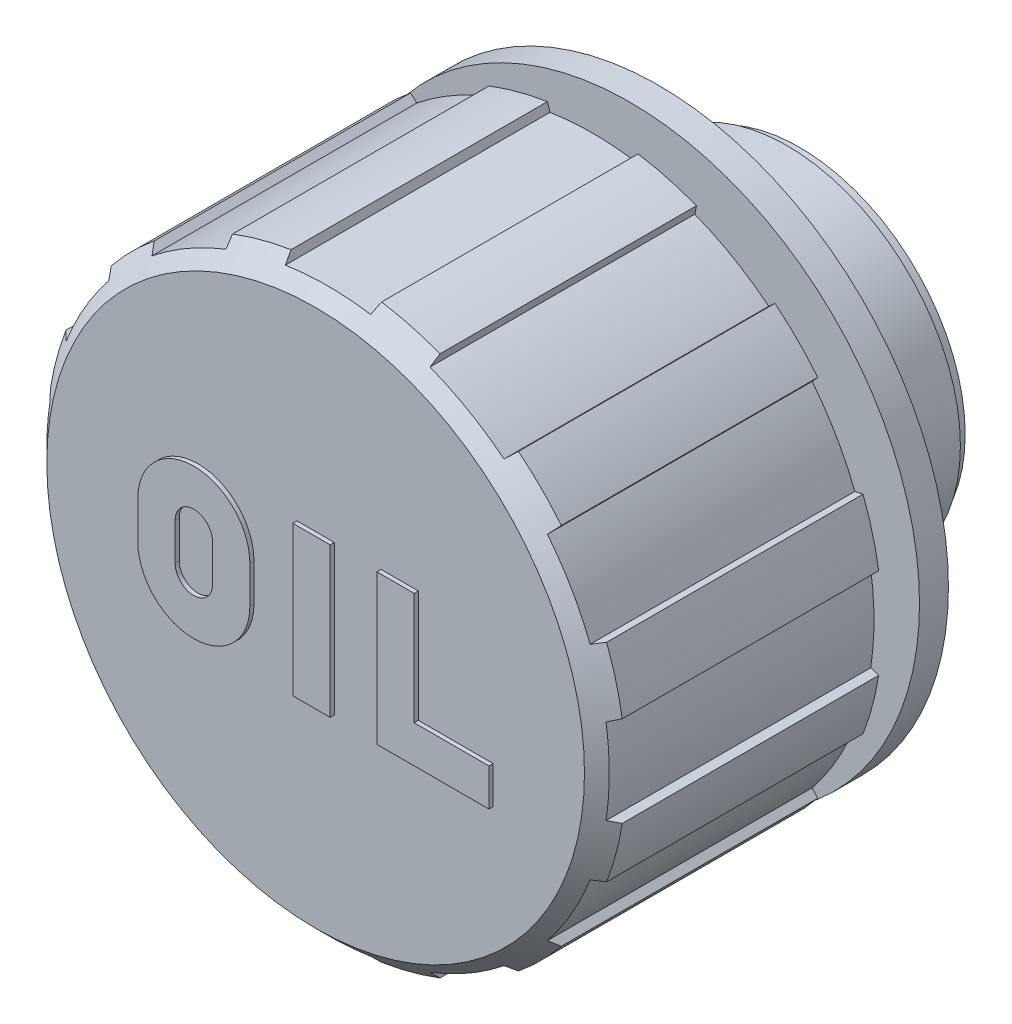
ISO-10303-21;
HEADER;
FILE_DESCRIPTION(('STEP AP214'),'2;1');
FILE_NAME('part.step','',(''),(''),'','','');
FILE_SCHEMA(('AUTOMOTIVE_DESIGN { 1 0 10303 214 1 1 1 1 }'));
ENDSEC;
DATA;
#1=APPLICATION_CONTEXT('core data for automotive mechanical design processes');
#2=APPLICATION_PROTOCOL_DEFINITION('international standard','automotive_design',2000,#1);
#3=PRODUCT_CONTEXT('',#1,'mechanical');
#4=PRODUCT('Part','Part','',(#3));
#5=PRODUCT_RELATED_PRODUCT_CATEGORY('part','',(#4));
#6=PRODUCT_DEFINITION_FORMATION('','',#4);
#7=PRODUCT_DEFINITION_CONTEXT('part definition',#1,'design');
#8=PRODUCT_DEFINITION('design','',#6,#7);
#9=PRODUCT_DEFINITION_SHAPE('','',#8);
#10=(LENGTH_UNIT() NAMED_UNIT(*) SI_UNIT(.MILLI.,.METRE.));
#11=(NAMED_UNIT(*) PLANE_ANGLE_UNIT() SI_UNIT($,.RADIAN.));
#12=(NAMED_UNIT(*) SI_UNIT($,.STERADIAN.) SOLID_ANGLE_UNIT());
#13=UNCERTAINTY_MEASURE_WITH_UNIT(LENGTH_MEASURE(1.E-05),#10,'distance_accuracy_value','');
#14=(GEOMETRIC_REPRESENTATION_CONTEXT(3) GLOBAL_UNCERTAINTY_ASSIGNED_CONTEXT((#13)) GLOBAL_UNIT_ASSIGNED_CONTEXT((#10,
#11,#12)) REPRESENTATION_CONTEXT('',''));
#15=CARTESIAN_POINT('',(0.,0.,0.));
#16=DIRECTION('',(0.,0.,1.));
#17=DIRECTION('',(1.,0.,0.));
#18=AXIS2_PLACEMENT_3D('',#15,#16,#17);
#19=CARTESIAN_POINT('',(0.,0.,7.25));
#20=DIRECTION('',(0.,0.,1.));
#21=DIRECTION('',(1.,0.,0.));
#22=AXIS2_PLACEMENT_3D('',#19,#20,#21);
#23=CYLINDRICAL_SURFACE('',#22,23.3333333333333);
#24=CARTESIAN_POINT('',(0.,0.,5.));
#25=DIRECTION('',(0.,0.,1.));
#26=DIRECTION('',(1.,0.,0.));
#27=AXIS2_PLACEMENT_3D('',#24,#25,#26);
#28=CIRCLE('',#27,23.3333333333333);
#29=CARTESIAN_POINT('',(23.3333333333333,0.,5.));
#30=VERTEX_POINT('',#29);
#31=EDGE_CURVE('E831',#30,#30,#28,.T.);
#32=ORIENTED_EDGE('',*,*,#31,.T.);
#33=EDGE_LOOP('',(#32));
#34=FACE_BOUND('',#33,.T.);
#35=CARTESIAN_POINT('',(0.,0.,9.5));
#36=DIRECTION('',(0.,0.,1.));
#37=DIRECTION('',(1.,0.,0.));
#38=AXIS2_PLACEMENT_3D('',#35,#36,#37);
#39=CIRCLE('',#38,23.3333333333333);
#40=CARTESIAN_POINT('',(23.3333333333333,0.,9.5));
#41=VERTEX_POINT('',#40);
#42=EDGE_CURVE('E381',#41,#41,#39,.T.);
#43=ORIENTED_EDGE('',*,*,#42,.F.);
#44=EDGE_LOOP('',(#43));
#45=FACE_BOUND('',#44,.T.);
#46=ADVANCED_FACE('F14',(#34,#45),#23,.T.);
#47=CARTESIAN_POINT('',(0.,29.1666666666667,5.));
#48=DIRECTION('',(0.,0.,1.));
#49=DIRECTION('',(1.,0.,0.));
#50=AXIS2_PLACEMENT_3D('',#47,#48,#49);
#51=PLANE('',#50);
#52=ORIENTED_EDGE('',*,*,#31,.F.);
#53=EDGE_LOOP('',(#52));
#54=FACE_BOUND('',#53,.T.);
#55=CARTESIAN_POINT('',(0.,0.,5.));
#56=DIRECTION('',(0.,0.,1.));
#57=DIRECTION('',(1.,0.,0.));
#58=AXIS2_PLACEMENT_3D('',#55,#56,#57);
#59=CIRCLE('',#58,35.);
#60=CARTESIAN_POINT('',(35.,0.,5.));
#61=VERTEX_POINT('',#60);
#62=EDGE_CURVE('E834',#61,#61,#59,.T.);
#63=ORIENTED_EDGE('',*,*,#62,.T.);
#64=EDGE_LOOP('',(#63));
#65=FACE_BOUND('',#64,.T.);
#66=ADVANCED_FACE('F888',(#54,#65),#51,.T.);
#67=CARTESIAN_POINT('',(0.,0.,3.25));
#68=DIRECTION('',(0.,0.,1.));
#69=DIRECTION('',(1.,0.,0.));
#70=AXIS2_PLACEMENT_3D('',#67,#68,#69);
#71=CYLINDRICAL_SURFACE('',#70,35.);
#72=CARTESIAN_POINT('',(0.,0.,1.5));
#73=DIRECTION('',(0.,0.,1.));
#74=DIRECTION('',(1.,0.,0.));
#75=AXIS2_PLACEMENT_3D('',#72,#73,#74);
#76=CIRCLE('',#75,35.);
#77=CARTESIAN_POINT('',(35.,0.,1.5));
#78=VERTEX_POINT('',#77);
#79=EDGE_CURVE('E837',#78,#78,#76,.T.);
#80=ORIENTED_EDGE('',*,*,#79,.T.);
#81=EDGE_LOOP('',(#80));
#82=FACE_BOUND('',#81,.T.);
#83=ORIENTED_EDGE('',*,*,#62,.F.);
#84=EDGE_LOOP('',(#83));
#85=FACE_BOUND('',#84,.T.);
#86=ADVANCED_FACE('F892',(#82,#85),#71,.T.);
#87=CARTESIAN_POINT('',(0.,33.4090909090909,1.5));
#88=DIRECTION('',(0.,0.,-1.));
#89=DIRECTION('',(-1.,0.,0.));
#90=AXIS2_PLACEMENT_3D('',#87,#88,#89);
#91=PLANE('',#90);
#92=ORIENTED_EDGE('',*,*,#79,.F.);
#93=EDGE_LOOP('',(#92));
#94=FACE_BOUND('',#93,.T.);
#95=CARTESIAN_POINT('',(0.,0.,1.5));
#96=DIRECTION('',(0.,0.,1.));
#97=DIRECTION('',(1.,0.,0.));
#98=AXIS2_PLACEMENT_3D('',#95,#96,#97);
#99=CIRCLE('',#98,31.8181818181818);
#100=CARTESIAN_POINT('',(31.8181818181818,0.,1.5));
#101=VERTEX_POINT('',#100);
#102=EDGE_CURVE('E840',#101,#101,#99,.T.);
#103=ORIENTED_EDGE('',*,*,#102,.T.);
#104=EDGE_LOOP('',(#103));
#105=FACE_BOUND('',#104,.T.);
#106=ADVANCED_FACE('F896',(#94,#105),#91,.T.);
#107=CARTESIAN_POINT('',(0.,0.,0.75));
#108=DIRECTION('',(0.,0.,1.));
#109=DIRECTION('',(1.,0.,0.));
#110=AXIS2_PLACEMENT_3D('',#107,#108,#109);
#111=CYLINDRICAL_SURFACE('',#110,31.8181818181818);
#112=CARTESIAN_POINT('',(0.,0.,0.));
#113=DIRECTION('',(0.,0.,1.));
#114=DIRECTION('',(1.,0.,0.));
#115=AXIS2_PLACEMENT_3D('',#112,#113,#114);
#116=CIRCLE('',#115,31.8181818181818);
#117=CARTESIAN_POINT('',(31.8181818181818,0.,0.));
#118=VERTEX_POINT('',#117);
#119=EDGE_CURVE('E843',#118,#118,#116,.T.);
#120=ORIENTED_EDGE('',*,*,#119,.T.);
#121=EDGE_LOOP('',(#120));
#122=FACE_BOUND('',#121,.T.);
#123=ORIENTED_EDGE('',*,*,#102,.F.);
#124=EDGE_LOOP('',(#123));
#125=FACE_BOUND('',#124,.T.);
#126=ADVANCED_FACE('F900',(#122,#125),#111,.T.);
#127=CARTESIAN_POINT('',(0.,26.3815909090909,0.));
#128=DIRECTION('',(0.,0.,-1.));
#129=DIRECTION('',(-1.,0.,0.));
#130=AXIS2_PLACEMENT_3D('',#127,#128,#129);
#131=PLANE('',#130);
#132=ORIENTED_EDGE('',*,*,#119,.F.);
#133=EDGE_LOOP('',(#132));
#134=FACE_BOUND('',#133,.T.);
#135=CARTESIAN_POINT('',(0.,0.,0.));
#136=DIRECTION('',(0.,0.,1.));
#137=DIRECTION('',(1.,0.,0.));
#138=AXIS2_PLACEMENT_3D('',#135,#136,#137);
#139=CIRCLE('',#138,20.945);
#140=CARTESIAN_POINT('',(20.945,0.,0.));
#141=VERTEX_POINT('',#140);
#142=EDGE_CURVE('E846',#141,#141,#139,.T.);
#143=ORIENTED_EDGE('',*,*,#142,.T.);
#144=EDGE_LOOP('',(#143));
#145=FACE_BOUND('',#144,.T.);
#146=ADVANCED_FACE('F904',(#134,#145),#131,.T.);
#147=CARTESIAN_POINT('',(0.,0.,-7.));
#148=DIRECTION('',(0.,0.,1.));
#149=DIRECTION('',(1.,0.,0.));
#150=AXIS2_PLACEMENT_3D('',#147,#148,#149);
#151=CYLINDRICAL_SURFACE('',#150,20.945);
#152=CARTESIAN_POINT('',(0.,0.,-14.));
#153=DIRECTION('',(0.,0.,1.));
#154=DIRECTION('',(1.,0.,0.));
#155=AXIS2_PLACEMENT_3D('',#152,#153,#154);
#156=CIRCLE('',#155,20.945);
#157=CARTESIAN_POINT('',(20.945,0.,-14.));
#158=VERTEX_POINT('',#157);
#159=EDGE_CURVE('E849',#158,#158,#156,.T.);
#160=ORIENTED_EDGE('',*,*,#159,.T.);
#161=EDGE_LOOP('',(#160));
#162=FACE_BOUND('',#161,.T.);
#163=ORIENTED_EDGE('',*,*,#142,.F.);
#164=EDGE_LOOP('',(#163));
#165=FACE_BOUND('',#164,.T.);
#166=ADVANCED_FACE('F908',(#162,#165),#151,.T.);
#167=CARTESIAN_POINT('',(0.,20.48492375,-14.));
#168=DIRECTION('',(0.,0.,-1.));
#169=DIRECTION('',(-1.,0.,0.));
#170=AXIS2_PLACEMENT_3D('',#167,#168,#169);
#171=PLANE('',#170);
#172=ORIENTED_EDGE('',*,*,#159,.F.);
#173=EDGE_LOOP('',(#172));
#174=FACE_BOUND('',#173,.T.);
#175=CARTESIAN_POINT('',(0.,0.,-14.));
#176=DIRECTION('',(0.,0.,1.));
#177=DIRECTION('',(1.,0.,0.));
#178=AXIS2_PLACEMENT_3D('',#175,#176,#177);
#179=CIRCLE('',#178,20.0248475);
#180=CARTESIAN_POINT('',(20.0248475,0.,-14.));
#181=VERTEX_POINT('',#180);
#182=EDGE_CURVE('E852',#181,#181,#179,.T.);
#183=ORIENTED_EDGE('',*,*,#182,.T.);
#184=EDGE_LOOP('',(#183));
#185=FACE_BOUND('',#184,.T.);
#186=ADVANCED_FACE('F912',(#174,#185),#171,.T.);
#187=CARTESIAN_POINT('',(0.,0.,-14.75));
#188=DIRECTION('',(0.,0.,1.));
#189=DIRECTION('',(1.,0.,0.));
#190=AXIS2_PLACEMENT_3D('',#187,#188,#189);
#191=CYLINDRICAL_SURFACE('',#190,20.0248475);
#192=CARTESIAN_POINT('',(0.,0.,-15.5));
#193=DIRECTION('',(0.,0.,1.));
#194=DIRECTION('',(1.,0.,0.));
#195=AXIS2_PLACEMENT_3D('',#192,#193,#194);
#196=CIRCLE('',#195,20.0248475);
#197=CARTESIAN_POINT('',(20.0248475,0.,-15.5));
#198=VERTEX_POINT('',#197);
#199=EDGE_CURVE('E855',#198,#198,#196,.T.);
#200=ORIENTED_EDGE('',*,*,#199,.T.);
#201=EDGE_LOOP('',(#200));
#202=FACE_BOUND('',#201,.T.);
#203=ORIENTED_EDGE('',*,*,#182,.F.);
#204=EDGE_LOOP('',(#203));
#205=FACE_BOUND('',#204,.T.);
#206=ADVANCED_FACE('F875',(#202,#205),#191,.T.);
#207=CARTESIAN_POINT('',(0.,15.76242375,-15.5));
#208=DIRECTION('',(0.,0.,-1.));
#209=DIRECTION('',(-1.,0.,0.));
#210=AXIS2_PLACEMENT_3D('',#207,#208,#209);
#211=PLANE('',#210);
#212=ORIENTED_EDGE('',*,*,#199,.F.);
#213=EDGE_LOOP('',(#212));
#214=FACE_BOUND('',#213,.T.);
#215=CARTESIAN_POINT('',(0.,0.,-15.5));
#216=DIRECTION('',(0.,0.,1.));
#217=DIRECTION('',(1.,0.,0.));
#218=AXIS2_PLACEMENT_3D('',#215,#216,#217);
#219=CIRCLE('',#218,11.5);
#220=CARTESIAN_POINT('',(11.5,0.,-15.5));
#221=VERTEX_POINT('',#220);
#222=EDGE_CURVE('E857',#221,#221,#219,.T.);
#223=ORIENTED_EDGE('',*,*,#222,.T.);
#224=EDGE_LOOP('',(#223));
#225=FACE_BOUND('',#224,.T.);
#226=ADVANCED_FACE('F868',(#214,#225),#211,.T.);
#227=CARTESIAN_POINT('',(0.,0.,-5.25));
#228=DIRECTION('',(0.,0.,1.));
#229=DIRECTION('',(1.,0.,0.));
#230=AXIS2_PLACEMENT_3D('',#227,#228,#229);
#231=CYLINDRICAL_SURFACE('',#230,11.5);
#232=CARTESIAN_POINT('',(0.,0.,5.));
#233=DIRECTION('',(0.,0.,1.));
#234=DIRECTION('',(1.,0.,0.));
#235=AXIS2_PLACEMENT_3D('',#232,#233,#234);
#236=CIRCLE('',#235,11.5);
#237=CARTESIAN_POINT('',(11.5,0.,5.));
#238=VERTEX_POINT('',#237);
#239=EDGE_CURVE('E18',#238,#238,#236,.F.);
#240=ORIENTED_EDGE('',*,*,#239,.F.);
#241=EDGE_LOOP('',(#240));
#242=FACE_BOUND('',#241,.T.);
#243=ORIENTED_EDGE('',*,*,#222,.F.);
#244=EDGE_LOOP('',(#243));
#245=FACE_BOUND('',#244,.T.);
#246=ADVANCED_FACE('F865',(#242,#245),#231,.F.);
#247=CARTESIAN_POINT('',(0.,5.75,5.));
#248=DIRECTION('',(0.,0.,-1.));
#249=DIRECTION('',(-1.,0.,0.));
#250=AXIS2_PLACEMENT_3D('',#247,#248,#249);
#251=PLANE('',#250);
#252=ORIENTED_EDGE('',*,*,#239,.T.);
#253=EDGE_LOOP('',(#252));
#254=FACE_BOUND('',#253,.T.);
#255=ADVANCED_FACE('F16',(#254),#251,.T.);
#256=CARTESIAN_POINT('',(0.,32.5,9.5));
#257=DIRECTION('',(0.,0.,-1.));
#258=DIRECTION('',(-1.,0.,0.));
#259=AXIS2_PLACEMENT_3D('',#256,#257,#258);
#260=PLANE('',#259);
#261=DIRECTION('',(-0.951056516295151,0.309016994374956,0.));
#262=VECTOR('',#261,1.);
#263=CARTESIAN_POINT('',(-33.6058248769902,5.16222184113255,9.5));
#264=LINE('',#263,#262);
#265=CARTESIAN_POINT('',(-33.6058248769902,5.16222184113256,9.5));
#266=VERTEX_POINT('',#265);
#267=CARTESIAN_POINT('',(-34.5690919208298,5.47520627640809,9.5));
#268=VERTEX_POINT('',#267);
#269=EDGE_CURVE('E1679',#266,#268,#264,.T.);
#270=ORIENTED_EDGE('',*,*,#269,.T.);
#271=CARTESIAN_POINT('',(6.11066752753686E-13,-1.04805053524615E-13,9.5));
#272=DIRECTION('',(0.,0.,1.));
#273=DIRECTION('',(1.,0.,0.));
#274=AXIS2_PLACEMENT_3D('',#271,#272,#273);
#275=CIRCLE('',#274,35.0000000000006);
#276=CARTESIAN_POINT('',(-32.6753149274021,12.5428782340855,9.5));
#277=VERTEX_POINT('',#276);
#278=EDGE_CURVE('E452',#277,#268,#275,.T.);
#279=ORIENTED_EDGE('',*,*,#278,.F.);
#280=DIRECTION('',(0.978147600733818,-0.207911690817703,0.));
#281=VECTOR('',#280,1.);
#282=CARTESIAN_POINT('',(-32.6753149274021,12.5428782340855,9.5));
#283=LINE('',#282,#281);
#284=CARTESIAN_POINT('',(-31.6846089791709,12.3322971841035,9.5));
#285=VERTEX_POINT('',#284);
#286=EDGE_CURVE('E1722',#277,#285,#283,.T.);
#287=ORIENTED_EDGE('',*,*,#286,.T.);
#288=CARTESIAN_POINT('',(2.1316282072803E-13,-1.91846538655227E-13,9.5));
#289=DIRECTION('',(0.,0.,1.));
#290=DIRECTION('',(1.,0.,0.));
#291=AXIS2_PLACEMENT_3D('',#288,#289,#290);
#292=CIRCLE('',#291,34.);
#293=CARTESIAN_POINT('',(-26.5223871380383,21.2735276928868,9.5));
#294=VERTEX_POINT('',#293);
#295=EDGE_CURVE('E457',#294,#285,#292,.T.);
#296=ORIENTED_EDGE('',*,*,#295,.F.);
#297=DIRECTION('',(-0.669130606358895,0.743144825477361,0.));
#298=VECTOR('',#297,1.);
#299=CARTESIAN_POINT('',(-26.5223871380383,21.2735276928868,9.5));
#300=LINE('',#299,#298);
#301=CARTESIAN_POINT('',(-27.200108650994,22.0262136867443,9.5));
#302=VERTEX_POINT('',#301);
#303=EDGE_CURVE('E1720',#294,#302,#300,.T.);
#304=ORIENTED_EDGE('',*,*,#303,.T.);
#305=CARTESIAN_POINT('',(1.52766688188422E-13,-3.12638803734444E-13,9.5));
#306=DIRECTION('',(0.,0.,1.));
#307=DIRECTION('',(1.,0.,0.));
#308=AXIS2_PLACEMENT_3D('',#305,#306,#307);
#309=CIRCLE('',#308,35.);
#310=CARTESIAN_POINT('',(-22.0262136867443,27.200108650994,9.5));
#311=VERTEX_POINT('',#310);
#312=EDGE_CURVE('E462',#311,#302,#309,.T.);
#313=ORIENTED_EDGE('',*,*,#312,.F.);
#314=DIRECTION('',(0.743144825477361,-0.669130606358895,0.));
#315=VECTOR('',#314,1.);
#316=CARTESIAN_POINT('',(-22.0262136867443,27.200108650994,9.5));
#317=LINE('',#316,#315);
#318=CARTESIAN_POINT('',(-21.2735276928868,26.5223871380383,9.5));
#319=VERTEX_POINT('',#318);
#320=EDGE_CURVE('E1718',#311,#319,#317,.T.);
#321=ORIENTED_EDGE('',*,*,#320,.T.);
#322=CARTESIAN_POINT('',(0.,-1.4210854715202E-13,9.5));
#323=DIRECTION('',(0.,0.,1.));
#324=DIRECTION('',(1.,0.,0.));
#325=AXIS2_PLACEMENT_3D('',#322,#323,#324);
#326=CIRCLE('',#325,34.);
#327=CARTESIAN_POINT('',(-12.3322971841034,31.6846089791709,9.5));
#328=VERTEX_POINT('',#327);
#329=EDGE_CURVE('E467',#328,#319,#326,.T.);
#330=ORIENTED_EDGE('',*,*,#329,.F.);
#331=DIRECTION('',(-0.207911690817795,0.978147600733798,0.));
#332=VECTOR('',#331,1.);
#333=CARTESIAN_POINT('',(-12.3322971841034,31.6846089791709,9.5));
#334=LINE('',#333,#332);
#335=CARTESIAN_POINT('',(-12.5428782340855,32.6753149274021,9.5));
#336=VERTEX_POINT('',#335);
#337=EDGE_CURVE('E1716',#328,#336,#334,.T.);
#338=ORIENTED_EDGE('',*,*,#337,.T.);
#339=CARTESIAN_POINT('',(1.58095758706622E-13,-1.62003743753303E-12,9.5));
#340=DIRECTION('',(0.,0.,1.));
#341=DIRECTION('',(1.,0.,0.));
#342=AXIS2_PLACEMENT_3D('',#339,#340,#341);
#343=CIRCLE('',#342,35.0000000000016);
#344=CARTESIAN_POINT('',(-5.47520627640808,34.5690919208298,9.5));
#345=VERTEX_POINT('',#344);
#346=EDGE_CURVE('E472',#345,#336,#343,.T.);
#347=ORIENTED_EDGE('',*,*,#346,.F.);
#348=DIRECTION('',(0.309016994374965,-0.951056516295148,0.));
#349=VECTOR('',#348,1.);
#350=CARTESIAN_POINT('',(-5.47520627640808,34.5690919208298,9.5));
#351=LINE('',#350,#349);
#352=CARTESIAN_POINT('',(-5.16222184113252,33.6058248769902,9.5));
#353=VERTEX_POINT('',#352);
#354=EDGE_CURVE('E1714',#345,#353,#351,.T.);
#355=ORIENTED_EDGE('',*,*,#354,.T.);
#356=CARTESIAN_POINT('',(1.54543045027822E-13,2.34479102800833E-13,9.5));
#357=DIRECTION('',(0.,0.,1.));
#358=DIRECTION('',(1.,0.,0.));
#359=AXIS2_PLACEMENT_3D('',#356,#357,#358);
#360=CIRCLE('',#359,34.);
#361=CARTESIAN_POINT('',(5.16222184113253,33.6058248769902,9.5));
#362=VERTEX_POINT('',#361);
#363=EDGE_CURVE('E477',#362,#353,#360,.T.);
#364=ORIENTED_EDGE('',*,*,#363,.F.);
#365=DIRECTION('',(0.309016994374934,0.951056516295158,0.));
#366=VECTOR('',#365,1.);
#367=CARTESIAN_POINT('',(5.16222184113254,33.6058248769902,9.5));
#368=LINE('',#367,#366);
#369=CARTESIAN_POINT('',(5.47520627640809,34.5690919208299,9.5));
#370=VERTEX_POINT('',#369);
#371=EDGE_CURVE('E1712',#362,#370,#368,.T.);
#372=ORIENTED_EDGE('',*,*,#371,.T.);
#373=CARTESIAN_POINT('',(-5.04485342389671E-13,-1.04449782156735E-12,9.5));
#374=DIRECTION('',(0.,0.,1.));
#375=DIRECTION('',(1.,0.,0.));
#376=AXIS2_PLACEMENT_3D('',#373,#374,#375);
#377=CIRCLE('',#376,35.0000000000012);
#378=CARTESIAN_POINT('',(12.5428782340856,32.6753149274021,9.5));
#379=VERTEX_POINT('',#378);
#380=EDGE_CURVE('E482',#379,#370,#377,.T.);
#381=ORIENTED_EDGE('',*,*,#380,.F.);
#382=DIRECTION('',(-0.207911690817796,-0.978147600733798,0.));
#383=VECTOR('',#382,1.);
#384=CARTESIAN_POINT('',(12.5428782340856,32.675314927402,9.5));
#385=LINE('',#384,#383);
#386=CARTESIAN_POINT('',(12.3322971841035,31.6846089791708,9.5));
#387=VERTEX_POINT('',#386);
#388=EDGE_CURVE('E1710',#379,#387,#385,.T.);
#389=ORIENTED_EDGE('',*,*,#388,.T.);
#390=CARTESIAN_POINT('',(4.72510919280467E-13,4.72510919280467E-13,9.5));
#391=DIRECTION('',(0.,0.,1.));
#392=DIRECTION('',(1.,0.,0.));
#393=AXIS2_PLACEMENT_3D('',#390,#391,#392);
#394=CIRCLE('',#393,33.9999999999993);
#395=CARTESIAN_POINT('',(21.2735276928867,26.5223871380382,9.5));
#396=VERTEX_POINT('',#395);
#397=EDGE_CURVE('E487',#396,#387,#394,.T.);
#398=ORIENTED_EDGE('',*,*,#397,.F.);
#399=DIRECTION('',(0.743144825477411,0.66913060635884,0.));
#400=VECTOR('',#399,1.);
#401=CARTESIAN_POINT('',(21.2735276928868,26.5223871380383,9.5));
#402=LINE('',#401,#400);
#403=CARTESIAN_POINT('',(22.0262136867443,27.2001086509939,9.5));
#404=VERTEX_POINT('',#403);
#405=EDGE_CURVE('E1708',#396,#404,#402,.T.);
#406=ORIENTED_EDGE('',*,*,#405,.T.);
#407=CARTESIAN_POINT('',(6.60804744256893E-13,5.61328761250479E-13,9.5));
#408=DIRECTION('',(0.,0.,1.));
#409=DIRECTION('',(1.,0.,0.));
#410=AXIS2_PLACEMENT_3D('',#407,#408,#409);
#411=CIRCLE('',#410,34.9999999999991);
#412=CARTESIAN_POINT('',(27.200108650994,22.0262136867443,9.5));
#413=VERTEX_POINT('',#412);
#414=EDGE_CURVE('E492',#413,#404,#411,.T.);
#415=ORIENTED_EDGE('',*,*,#414,.F.);
#416=DIRECTION('',(-0.669130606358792,-0.743144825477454,0.));
#417=VECTOR('',#416,1.);
#418=CARTESIAN_POINT('',(27.200108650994,22.0262136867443,9.5));
#419=LINE('',#418,#417);
#420=CARTESIAN_POINT('',(26.5223871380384,21.2735276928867,9.5));
#421=VERTEX_POINT('',#420);
#422=EDGE_CURVE('E1706',#413,#421,#419,.T.);
#423=ORIENTED_EDGE('',*,*,#422,.T.);
#424=CARTESIAN_POINT('',(0.,0.,9.5));
#425=DIRECTION('',(0.,0.,1.));
#426=DIRECTION('',(1.,0.,0.));
#427=AXIS2_PLACEMENT_3D('',#424,#425,#426);
#428=CIRCLE('',#427,34.);
#429=CARTESIAN_POINT('',(31.6846089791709,12.3322971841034,9.5));
#430=VERTEX_POINT('',#429);
#431=EDGE_CURVE('E497',#430,#421,#428,.T.);
#432=ORIENTED_EDGE('',*,*,#431,.F.);
#433=DIRECTION('',(0.978147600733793,0.207911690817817,0.));
#434=VECTOR('',#433,1.);
#435=CARTESIAN_POINT('',(31.6846089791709,12.3322971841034,9.5));
#436=LINE('',#435,#434);
#437=CARTESIAN_POINT('',(32.675314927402,12.5428782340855,9.5));
#438=VERTEX_POINT('',#437);
#439=EDGE_CURVE('E1704',#430,#438,#436,.T.);
#440=ORIENTED_EDGE('',*,*,#439,.T.);
#441=CARTESIAN_POINT('',(1.442401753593E-12,2.17603712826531E-13,9.5));
#442=DIRECTION('',(0.,0.,1.));
#443=DIRECTION('',(1.,0.,0.));
#444=AXIS2_PLACEMENT_3D('',#441,#442,#443);
#445=CIRCLE('',#444,34.9999999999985);
#446=CARTESIAN_POINT('',(34.5690919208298,5.47520627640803,9.5));
#447=VERTEX_POINT('',#446);
#448=EDGE_CURVE('E502',#447,#438,#445,.T.);
#449=ORIENTED_EDGE('',*,*,#448,.F.);
#450=DIRECTION('',(-0.951056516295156,-0.30901699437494,0.));
#451=VECTOR('',#450,1.);
#452=CARTESIAN_POINT('',(34.5690919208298,5.47520627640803,9.5));
#453=LINE('',#452,#451);
#454=CARTESIAN_POINT('',(33.6058248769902,5.16222184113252,9.5));
#455=VERTEX_POINT('',#454);
#456=EDGE_CURVE('E1702',#447,#455,#453,.T.);
#457=ORIENTED_EDGE('',*,*,#456,.T.);
#458=CARTESIAN_POINT('',(2.41584530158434E-13,0.,9.5));
#459=DIRECTION('',(0.,0.,1.));
#460=DIRECTION('',(1.,0.,0.));
#461=AXIS2_PLACEMENT_3D('',#458,#459,#460);
#462=CIRCLE('',#461,34.);
#463=CARTESIAN_POINT('',(33.6058248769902,-5.16222184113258,9.5));
#464=VERTEX_POINT('',#463);
#465=EDGE_CURVE('E507',#464,#455,#462,.T.);
#466=ORIENTED_EDGE('',*,*,#465,.F.);
#467=DIRECTION('',(0.951056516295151,-0.309016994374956,0.));
#468=VECTOR('',#467,1.);
#469=CARTESIAN_POINT('',(33.6058248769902,-5.16222184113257,9.5));
#470=LINE('',#469,#468);
#471=CARTESIAN_POINT('',(34.5690919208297,-5.47520627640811,9.5));
#472=VERTEX_POINT('',#471);
#473=EDGE_CURVE('E1700',#464,#472,#470,.T.);
#474=ORIENTED_EDGE('',*,*,#473,.T.);
#475=CARTESIAN_POINT('',(-3.69482222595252E-13,0.,9.5));
#476=DIRECTION('',(0.,0.,1.));
#477=DIRECTION('',(1.,0.,0.));
#478=AXIS2_PLACEMENT_3D('',#475,#476,#477);
#479=CIRCLE('',#478,35.);
#480=CARTESIAN_POINT('',(32.675314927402,-12.5428782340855,9.5));
#481=VERTEX_POINT('',#480);
#482=EDGE_CURVE('E512',#481,#472,#479,.T.);
#483=ORIENTED_EDGE('',*,*,#482,.F.);
#484=DIRECTION('',(-0.978147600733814,0.207911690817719,0.));
#485=VECTOR('',#484,1.);
#486=CARTESIAN_POINT('',(32.675314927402,-12.5428782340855,9.5));
#487=LINE('',#486,#485);
#488=CARTESIAN_POINT('',(31.6846089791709,-12.3322971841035,9.5));
#489=VERTEX_POINT('',#488);
#490=EDGE_CURVE('E1698',#481,#489,#487,.T.);
#491=ORIENTED_EDGE('',*,*,#490,.T.);
#492=CARTESIAN_POINT('',(-3.23296944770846E-13,3.01980662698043E-13,9.5));
#493=DIRECTION('',(0.,0.,1.));
#494=DIRECTION('',(1.,0.,0.));
#495=AXIS2_PLACEMENT_3D('',#492,#493,#494);
#496=CIRCLE('',#495,34.0000000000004);
#497=CARTESIAN_POINT('',(26.5223871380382,-21.2735276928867,9.5));
#498=VERTEX_POINT('',#497);
#499=EDGE_CURVE('E517',#498,#489,#496,.T.);
#500=ORIENTED_EDGE('',*,*,#499,.F.);
#501=DIRECTION('',(0.669130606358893,-0.743144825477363,0.));
#502=VECTOR('',#501,1.);
#503=CARTESIAN_POINT('',(26.5223871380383,-21.2735276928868,9.5));
#504=LINE('',#503,#502);
#505=CARTESIAN_POINT('',(27.200108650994,-22.0262136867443,9.5));
#506=VERTEX_POINT('',#505);
#507=EDGE_CURVE('E1696',#498,#506,#504,.T.);
#508=ORIENTED_EDGE('',*,*,#507,.T.);
#509=CARTESIAN_POINT('',(9.02389274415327E-13,-8.10018718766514E-13,9.5));
#510=DIRECTION('',(0.,0.,1.));
#511=DIRECTION('',(1.,0.,0.));
#512=AXIS2_PLACEMENT_3D('',#509,#510,#511);
#513=CIRCLE('',#512,34.9999999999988);
#514=CARTESIAN_POINT('',(22.0262136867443,-27.200108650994,9.5));
#515=VERTEX_POINT('',#514);
#516=EDGE_CURVE('E522',#515,#506,#513,.T.);
#517=ORIENTED_EDGE('',*,*,#516,.F.);
#518=DIRECTION('',(-0.743144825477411,0.66913060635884,0.));
#519=VECTOR('',#518,1.);
#520=CARTESIAN_POINT('',(22.0262136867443,-27.200108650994,9.5));
#521=LINE('',#520,#519);
#522=CARTESIAN_POINT('',(21.2735276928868,-26.5223871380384,9.5));
#523=VERTEX_POINT('',#522);
#524=EDGE_CURVE('E1694',#515,#523,#521,.T.);
#525=ORIENTED_EDGE('',*,*,#524,.T.);
#526=CARTESIAN_POINT('',(0.,2.70006239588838E-13,9.5));
#527=DIRECTION('',(0.,0.,1.));
#528=DIRECTION('',(1.,0.,0.));
#529=AXIS2_PLACEMENT_3D('',#526,#527,#528);
#530=CIRCLE('',#529,34.);
#531=CARTESIAN_POINT('',(12.3322971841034,-31.6846089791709,9.5));
#532=VERTEX_POINT('',#531);
#533=EDGE_CURVE('E527',#532,#523,#530,.T.);
#534=ORIENTED_EDGE('',*,*,#533,.F.);
#535=DIRECTION('',(0.207911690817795,-0.978147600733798,0.));
#536=VECTOR('',#535,1.);
#537=CARTESIAN_POINT('',(12.3322971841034,-31.6846089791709,9.5));
#538=LINE('',#537,#536);
#539=CARTESIAN_POINT('',(12.5428782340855,-32.6753149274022,9.5));
#540=VERTEX_POINT('',#539);
#541=EDGE_CURVE('E805',#532,#540,#538,.T.);
#542=ORIENTED_EDGE('',*,*,#541,.T.);
#543=CARTESIAN_POINT('',(0.,8.81072992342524E-13,9.5));
#544=DIRECTION('',(0.,0.,1.));
#545=DIRECTION('',(1.,0.,0.));
#546=AXIS2_PLACEMENT_3D('',#543,#544,#545);
#547=CIRCLE('',#546,35.0000000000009);
#548=CARTESIAN_POINT('',(5.47520627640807,-34.5690919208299,9.5));
#549=VERTEX_POINT('',#548);
#550=EDGE_CURVE('E532',#549,#540,#547,.T.);
#551=ORIENTED_EDGE('',*,*,#550,.F.);
#552=DIRECTION('',(-0.309016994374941,0.951056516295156,0.));
#553=VECTOR('',#552,1.);
#554=CARTESIAN_POINT('',(5.47520627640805,-34.5690919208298,9.5));
#555=LINE('',#554,#553);
#556=CARTESIAN_POINT('',(5.16222184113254,-33.6058248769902,9.5));
#557=VERTEX_POINT('',#556);
#558=EDGE_CURVE('E551',#549,#557,#555,.T.);
#559=ORIENTED_EDGE('',*,*,#558,.T.);
#560=CARTESIAN_POINT('',(0.,-2.34479102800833E-13,9.5));
#561=DIRECTION('',(0.,0.,1.));
#562=DIRECTION('',(1.,0.,0.));
#563=AXIS2_PLACEMENT_3D('',#560,#561,#562);
#564=CIRCLE('',#563,34.);
#565=CARTESIAN_POINT('',(-5.16222184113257,-33.6058248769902,9.5));
#566=VERTEX_POINT('',#565);
#567=EDGE_CURVE('E417',#566,#557,#564,.T.);
#568=ORIENTED_EDGE('',*,*,#567,.F.);
#569=DIRECTION('',(-0.309016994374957,-0.95105651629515,0.));
#570=VECTOR('',#569,1.);
#571=CARTESIAN_POINT('',(-5.16222184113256,-33.6058248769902,9.5));
#572=LINE('',#571,#570);
#573=CARTESIAN_POINT('',(-5.47520627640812,-34.5690919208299,9.5));
#574=VERTEX_POINT('',#573);
#575=EDGE_CURVE('E1691',#566,#574,#572,.T.);
#576=ORIENTED_EDGE('',*,*,#575,.T.);
#577=CARTESIAN_POINT('',(2.8066438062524E-13,1.55608859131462E-12,9.5));
#578=DIRECTION('',(0.,0.,1.));
#579=DIRECTION('',(1.,0.,0.));
#580=AXIS2_PLACEMENT_3D('',#577,#578,#579);
#581=CIRCLE('',#580,35.0000000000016);
#582=CARTESIAN_POINT('',(-12.5428782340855,-32.6753149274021,9.5));
#583=VERTEX_POINT('',#582);
#584=EDGE_CURVE('E422',#583,#574,#581,.T.);
#585=ORIENTED_EDGE('',*,*,#584,.F.);
#586=DIRECTION('',(0.207911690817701,0.978147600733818,0.));
#587=VECTOR('',#586,1.);
#588=CARTESIAN_POINT('',(-12.5428782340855,-32.6753149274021,9.5));
#589=LINE('',#588,#587);
#590=CARTESIAN_POINT('',(-12.3322971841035,-31.6846089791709,9.5));
#591=VERTEX_POINT('',#590);
#592=EDGE_CURVE('E1689',#583,#591,#589,.T.);
#593=ORIENTED_EDGE('',*,*,#592,.T.);
#594=CARTESIAN_POINT('',(0.,0.,9.5));
#595=DIRECTION('',(0.,0.,1.));
#596=DIRECTION('',(1.,0.,0.));
#597=AXIS2_PLACEMENT_3D('',#594,#595,#596);
#598=CIRCLE('',#597,34.);
#599=CARTESIAN_POINT('',(-21.2735276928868,-26.5223871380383,9.5));
#600=VERTEX_POINT('',#599);
#601=EDGE_CURVE('E427',#600,#591,#598,.T.);
#602=ORIENTED_EDGE('',*,*,#601,.F.);
#603=DIRECTION('',(-0.74314482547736,-0.669130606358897,0.));
#604=VECTOR('',#603,1.);
#605=CARTESIAN_POINT('',(-21.2735276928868,-26.5223871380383,9.5));
#606=LINE('',#605,#604);
#607=CARTESIAN_POINT('',(-22.0262136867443,-27.200108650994,9.5));
#608=VERTEX_POINT('',#607);
#609=EDGE_CURVE('E1687',#600,#608,#606,.T.);
#610=ORIENTED_EDGE('',*,*,#609,.T.);
#611=CARTESIAN_POINT('',(0.,0.,9.5));
#612=DIRECTION('',(0.,0.,1.));
#613=DIRECTION('',(1.,0.,0.));
#614=AXIS2_PLACEMENT_3D('',#611,#612,#613);
#615=CIRCLE('',#614,35.);
#616=CARTESIAN_POINT('',(-27.200108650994,-22.0262136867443,9.5));
#617=VERTEX_POINT('',#616);
#618=EDGE_CURVE('E432',#617,#608,#615,.T.);
#619=ORIENTED_EDGE('',*,*,#618,.F.);
#620=DIRECTION('',(0.669130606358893,0.743144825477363,0.));
#621=VECTOR('',#620,1.);
#622=CARTESIAN_POINT('',(-27.200108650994,-22.0262136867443,9.5));
#623=LINE('',#622,#621);
#624=CARTESIAN_POINT('',(-26.5223871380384,-21.2735276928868,9.5));
#625=VERTEX_POINT('',#624);
#626=EDGE_CURVE('E1685',#617,#625,#623,.T.);
#627=ORIENTED_EDGE('',*,*,#626,.T.);
#628=CARTESIAN_POINT('',(0.,0.,9.5));
#629=DIRECTION('',(0.,0.,1.));
#630=DIRECTION('',(1.,0.,0.));
#631=AXIS2_PLACEMENT_3D('',#628,#629,#630);
#632=CIRCLE('',#631,34.);
#633=CARTESIAN_POINT('',(-31.6846089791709,-12.3322971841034,9.5));
#634=VERTEX_POINT('',#633);
#635=EDGE_CURVE('E437',#634,#625,#632,.T.);
#636=ORIENTED_EDGE('',*,*,#635,.F.);
#637=DIRECTION('',(-0.978147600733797,-0.207911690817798,0.));
#638=VECTOR('',#637,1.);
#639=CARTESIAN_POINT('',(-31.6846089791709,-12.3322971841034,9.5));
#640=LINE('',#639,#638);
#641=CARTESIAN_POINT('',(-32.6753149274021,-12.5428782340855,9.5));
#642=VERTEX_POINT('',#641);
#643=EDGE_CURVE('E1683',#634,#642,#640,.T.);
#644=ORIENTED_EDGE('',*,*,#643,.T.);
#645=CARTESIAN_POINT('',(0.,0.,9.5));
#646=DIRECTION('',(0.,0.,1.));
#647=DIRECTION('',(1.,0.,0.));
#648=AXIS2_PLACEMENT_3D('',#645,#646,#647);
#649=CIRCLE('',#648,35.);
#650=CARTESIAN_POINT('',(-34.5690919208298,-5.47520627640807,9.5));
#651=VERTEX_POINT('',#650);
#652=EDGE_CURVE('E442',#651,#642,#649,.T.);
#653=ORIENTED_EDGE('',*,*,#652,.F.);
#654=DIRECTION('',(0.951056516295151,0.309016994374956,0.));
#655=VECTOR('',#654,1.);
#656=CARTESIAN_POINT('',(-34.5690919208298,-5.47520627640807,9.5));
#657=LINE('',#656,#655);
#658=CARTESIAN_POINT('',(-33.6058248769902,-5.16222184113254,9.5));
#659=VERTEX_POINT('',#658);
#660=EDGE_CURVE('E1681',#651,#659,#657,.T.);
#661=ORIENTED_EDGE('',*,*,#660,.T.);
#662=CARTESIAN_POINT('',(0.,0.,9.5));
#663=DIRECTION('',(0.,0.,1.));
#664=DIRECTION('',(1.,0.,0.));
#665=AXIS2_PLACEMENT_3D('',#662,#663,#664);
#666=CIRCLE('',#665,34.);
#667=EDGE_CURVE('E447',#266,#659,#666,.T.);
#668=ORIENTED_EDGE('',*,*,#667,.F.);
#669=EDGE_LOOP('',(#270,#279,#287,#296,#304,#313,#321,#330,#338,#347,#355,#364,#372,#381,#389,
#398,#406,#415,#423,#432,#440,#449,#457,#466,#474,#483,#491,#500,#508,#517,#525,#534,#542,#551,
#559,#568,#576,#585,#593,#602,#610,#619,#627,#636,#644,#653,#661,#668));
#670=FACE_BOUND('',#669,.T.);
#671=ORIENTED_EDGE('',*,*,#42,.T.);
#672=EDGE_LOOP('',(#671));
#673=FACE_BOUND('',#672,.T.);
#674=ADVANCED_FACE('F874',(#670,#673),#260,.T.);
#675=CARTESIAN_POINT('',(-33.6058248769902,5.16222184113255,43.5));
#676=DIRECTION('',(0.309016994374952,0.951056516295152,0.));
#677=DIRECTION('',(-0.951056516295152,0.309016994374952,0.));
#678=AXIS2_PLACEMENT_3D('',#675,#676,#677);
#679=PLANE('',#678);
#680=DIRECTION('',(0.,0.,1.));
#681=VECTOR('',#680,1.);
#682=CARTESIAN_POINT('',(-34.5690919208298,5.47520627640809,43.5));
#683=LINE('',#682,#681);
#684=CARTESIAN_POINT('',(-34.5690919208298,5.47520627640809,40.5));
#685=VERTEX_POINT('',#684);
#686=EDGE_CURVE('E455',#268,#685,#683,.T.);
#687=ORIENTED_EDGE('',*,*,#686,.F.);
#688=ORIENTED_EDGE('',*,*,#269,.F.);
#689=DIRECTION('',(0.,0.,1.));
#690=VECTOR('',#689,1.);
#691=CARTESIAN_POINT('',(-33.6058248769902,5.16222184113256,43.5));
#692=LINE('',#691,#690);
#693=CARTESIAN_POINT('',(-33.6058248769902,5.16222184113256,41.5));
#694=VERTEX_POINT('',#693);
#695=EDGE_CURVE('E451',#694,#266,#692,.F.);
#696=ORIENTED_EDGE('',*,*,#695,.F.);
#697=CARTESIAN_POINT('',(-34.5690919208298,5.47520627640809,40.5));
#698=CARTESIAN_POINT('',(-34.4085770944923,5.42305184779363,40.6666982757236));
#699=CARTESIAN_POINT('',(-34.2480474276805,5.37089259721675,40.8333807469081));
#700=CARTESIAN_POINT('',(-33.9269584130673,5.26656445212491,41.1667140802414));
#701=CARTESIAN_POINT('',(-33.7663990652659,5.21439555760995,41.3333649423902));
#702=CARTESIAN_POINT('',(-33.6058248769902,5.16222184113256,41.5));
#703=B_SPLINE_CURVE_WITH_KNOTS('',3,(#697,#698,#699,#700,#701,#702),.UNSPECIFIED.,.F.,.F.,(4,2,
4),(0.,0.711660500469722,1.42332100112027),.UNSPECIFIED.);
#704=EDGE_CURVE('E716',#685,#694,#703,.T.);
#705=ORIENTED_EDGE('',*,*,#704,.F.);
#706=EDGE_LOOP('',(#687,#688,#696,#705));
#707=FACE_BOUND('',#706,.T.);
#708=ADVANCED_FACE('F959',(#707),#679,.F.);
#709=CARTESIAN_POINT('',(6.11066752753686E-13,-1.04805053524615E-13,43.5));
#710=DIRECTION('',(0.,0.,1.));
#711=DIRECTION('',(1.,0.,0.));
#712=AXIS2_PLACEMENT_3D('',#709,#710,#711);
#713=CYLINDRICAL_SURFACE('',#712,35.0000000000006);
#714=ORIENTED_EDGE('',*,*,#278,.T.);
#715=ORIENTED_EDGE('',*,*,#686,.T.);
#716=CARTESIAN_POINT('',(0.,0.,40.5));
#717=DIRECTION('',(0.,0.,-1.));
#718=DIRECTION('',(0.,1.,0.));
#719=AXIS2_PLACEMENT_3D('',#716,#717,#718);
#720=CIRCLE('',#719,35.);
#721=CARTESIAN_POINT('',(-32.6753149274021,12.5428782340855,40.5));
#722=VERTEX_POINT('',#721);
#723=EDGE_CURVE('E1767',#722,#685,#720,.F.);
#724=ORIENTED_EDGE('',*,*,#723,.F.);
#725=DIRECTION('',(0.,0.,1.));
#726=VECTOR('',#725,1.);
#727=CARTESIAN_POINT('',(-32.6753149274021,12.5428782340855,43.5));
#728=LINE('',#727,#726);
#729=EDGE_CURVE('E456',#722,#277,#728,.F.);
#730=ORIENTED_EDGE('',*,*,#729,.T.);
#731=EDGE_LOOP('',(#714,#715,#724,#730));
#732=FACE_BOUND('',#731,.T.);
#733=ADVANCED_FACE('F968',(#732),#713,.T.);
#734=CARTESIAN_POINT('',(-32.6753149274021,12.5428782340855,43.5));
#735=DIRECTION('',(-0.207911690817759,-0.978147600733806,0.));
#736=DIRECTION('',(0.978147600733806,-0.207911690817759,0.));
#737=AXIS2_PLACEMENT_3D('',#734,#735,#736);
#738=PLANE('',#737);
#739=DIRECTION('',(0.,0.,1.));
#740=VECTOR('',#739,1.);
#741=CARTESIAN_POINT('',(-31.6846089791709,12.3322971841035,43.5));
#742=LINE('',#741,#740);
#743=CARTESIAN_POINT('',(-31.6846089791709,12.3322971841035,41.5));
#744=VERTEX_POINT('',#743);
#745=EDGE_CURVE('E460',#285,#744,#742,.T.);
#746=ORIENTED_EDGE('',*,*,#745,.F.);
#747=ORIENTED_EDGE('',*,*,#286,.F.);
#748=ORIENTED_EDGE('',*,*,#729,.F.);
#749=CARTESIAN_POINT('',(-31.6846089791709,12.3322971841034,41.5));
#750=CARTESIAN_POINT('',(-31.8497571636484,12.367400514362,41.3333649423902));
#751=CARTESIAN_POINT('',(-32.0148900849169,12.4025006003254,41.1667140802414));
#752=CARTESIAN_POINT('',(-32.345125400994,12.4726942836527,40.8333807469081));
#753=CARTESIAN_POINT('',(-32.5102277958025,12.5077878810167,40.6666982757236));
#754=CARTESIAN_POINT('',(-32.6753149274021,12.5428782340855,40.5));
#755=B_SPLINE_CURVE_WITH_KNOTS('',3,(#749,#750,#751,#752,#753,#754),.UNSPECIFIED.,.F.,.F.,(4,2,
4),(0.,0.711660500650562,1.42332100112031),.UNSPECIFIED.);
#756=EDGE_CURVE('E724',#744,#722,#755,.T.);
#757=ORIENTED_EDGE('',*,*,#756,.F.);
#758=EDGE_LOOP('',(#746,#747,#748,#757));
#759=FACE_BOUND('',#758,.T.);
#760=ADVANCED_FACE('F977',(#759),#738,.F.);
#761=CARTESIAN_POINT('',(2.1316282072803E-13,-1.91846538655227E-13,43.5));
#762=DIRECTION('',(0.,0.,1.));
#763=DIRECTION('',(1.,0.,0.));
#764=AXIS2_PLACEMENT_3D('',#761,#762,#763);
#765=CYLINDRICAL_SURFACE('',#764,34.);
#766=ORIENTED_EDGE('',*,*,#295,.T.);
#767=ORIENTED_EDGE('',*,*,#745,.T.);
#768=CARTESIAN_POINT('',(0.,0.,41.5));
#769=DIRECTION('',(0.,0.,-1.));
#770=DIRECTION('',(0.,1.,0.));
#771=AXIS2_PLACEMENT_3D('',#768,#769,#770);
#772=CIRCLE('',#771,34.);
#773=CARTESIAN_POINT('',(-26.5223871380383,21.2735276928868,41.5));
#774=VERTEX_POINT('',#773);
#775=EDGE_CURVE('E1774',#774,#744,#772,.F.);
#776=ORIENTED_EDGE('',*,*,#775,.F.);
#777=DIRECTION('',(0.,0.,1.));
#778=VECTOR('',#777,1.);
#779=CARTESIAN_POINT('',(-26.5223871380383,21.2735276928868,43.5));
#780=LINE('',#779,#778);
#781=EDGE_CURVE('E461',#774,#294,#780,.F.);
#782=ORIENTED_EDGE('',*,*,#781,.T.);
#783=EDGE_LOOP('',(#766,#767,#776,#782));
#784=FACE_BOUND('',#783,.T.);
#785=ADVANCED_FACE('F987',(#784),#765,.T.);
#786=CARTESIAN_POINT('',(-26.5223871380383,21.2735276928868,43.5));
#787=DIRECTION('',(0.743144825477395,0.669130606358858,0.));
#788=DIRECTION('',(-0.669130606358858,0.743144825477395,0.));
#789=AXIS2_PLACEMENT_3D('',#786,#787,#788);
#790=PLANE('',#789);
#791=DIRECTION('',(0.,0.,1.));
#792=VECTOR('',#791,1.);
#793=CARTESIAN_POINT('',(-27.200108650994,22.0262136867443,43.5));
#794=LINE('',#793,#792);
#795=CARTESIAN_POINT('',(-27.200108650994,22.0262136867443,40.5));
#796=VERTEX_POINT('',#795);
#797=EDGE_CURVE('E465',#302,#796,#794,.T.);
#798=ORIENTED_EDGE('',*,*,#797,.F.);
#799=ORIENTED_EDGE('',*,*,#303,.F.);
#800=ORIENTED_EDGE('',*,*,#781,.F.);
#801=CARTESIAN_POINT('',(-27.200108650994,22.0262136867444,40.5));
#802=CARTESIAN_POINT('',(-27.0871759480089,21.9007892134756,40.6666982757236));
#803=CARTESIAN_POINT('',(-26.9742328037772,21.7753531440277,40.8333807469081));
#804=CARTESIAN_POINT('',(-26.748325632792,21.5244578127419,41.1667140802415));
#805=CARTESIAN_POINT('',(-26.6353616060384,21.3989985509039,41.3333649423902));
#806=CARTESIAN_POINT('',(-26.5223871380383,21.2735276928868,41.5));
#807=B_SPLINE_CURVE_WITH_KNOTS('',3,(#801,#802,#803,#804,#805,#806),.UNSPECIFIED.,.F.,.F.,(4,2,
4),(0.,0.711660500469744,1.42332100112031),.UNSPECIFIED.);
#808=EDGE_CURVE('E731',#796,#774,#807,.T.);
#809=ORIENTED_EDGE('',*,*,#808,.F.);
#810=EDGE_LOOP('',(#798,#799,#800,#809));
#811=FACE_BOUND('',#810,.T.);
#812=ADVANCED_FACE('F749',(#811),#790,.F.);
#813=CARTESIAN_POINT('',(1.52766688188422E-13,-3.12638803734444E-13,43.5));
#814=DIRECTION('',(0.,0.,1.));
#815=DIRECTION('',(1.,0.,0.));
#816=AXIS2_PLACEMENT_3D('',#813,#814,#815);
#817=CYLINDRICAL_SURFACE('',#816,35.);
#818=ORIENTED_EDGE('',*,*,#312,.T.);
#819=ORIENTED_EDGE('',*,*,#797,.T.);
#820=CARTESIAN_POINT('',(0.,0.,40.5));
#821=DIRECTION('',(0.,0.,-1.));
#822=DIRECTION('',(0.,1.,0.));
#823=AXIS2_PLACEMENT_3D('',#820,#821,#822);
#824=CIRCLE('',#823,35.);
#825=CARTESIAN_POINT('',(-22.0262136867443,27.200108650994,40.5));
#826=VERTEX_POINT('',#825);
#827=EDGE_CURVE('E1781',#826,#796,#824,.F.);
#828=ORIENTED_EDGE('',*,*,#827,.F.);
#829=DIRECTION('',(0.,0.,1.));
#830=VECTOR('',#829,1.);
#831=CARTESIAN_POINT('',(-22.0262136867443,27.200108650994,43.5));
#832=LINE('',#831,#830);
#833=EDGE_CURVE('E466',#826,#311,#832,.F.);
#834=ORIENTED_EDGE('',*,*,#833,.T.);
#835=EDGE_LOOP('',(#818,#819,#828,#834));
#836=FACE_BOUND('',#835,.T.);
#837=ADVANCED_FACE('F747',(#836),#817,.T.);
#838=CARTESIAN_POINT('',(-22.0262136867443,27.200108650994,43.5));
#839=DIRECTION('',(-0.669130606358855,-0.743144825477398,0.));
#840=DIRECTION('',(0.743144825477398,-0.669130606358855,0.));
#841=AXIS2_PLACEMENT_3D('',#838,#839,#840);
#842=PLANE('',#841);
#843=DIRECTION('',(0.,0.,1.));
#844=VECTOR('',#843,1.);
#845=CARTESIAN_POINT('',(-21.2735276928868,26.5223871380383,43.5));
#846=LINE('',#845,#844);
#847=CARTESIAN_POINT('',(-21.2735276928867,26.5223871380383,41.5));
#848=VERTEX_POINT('',#847);
#849=EDGE_CURVE('E470',#319,#848,#846,.T.);
#850=ORIENTED_EDGE('',*,*,#849,.F.);
#851=ORIENTED_EDGE('',*,*,#320,.F.);
#852=ORIENTED_EDGE('',*,*,#833,.F.);
#853=CARTESIAN_POINT('',(-21.2735276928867,26.5223871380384,41.5));
#854=CARTESIAN_POINT('',(-21.3989985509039,26.6353616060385,41.3333649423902));
#855=CARTESIAN_POINT('',(-21.5244578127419,26.748325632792,41.1667140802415));
#856=CARTESIAN_POINT('',(-21.7753531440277,26.9742328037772,40.8333807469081));
#857=CARTESIAN_POINT('',(-21.9007892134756,27.0871759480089,40.6666982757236));
#858=CARTESIAN_POINT('',(-22.0262136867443,27.200108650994,40.5));
#859=B_SPLINE_CURVE_WITH_KNOTS('',3,(#853,#854,#855,#856,#857,#858),.UNSPECIFIED.,.F.,.F.,(4,2,
4),(0.,0.71166050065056,1.42332100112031),.UNSPECIFIED.);
#860=EDGE_CURVE('E737',#848,#826,#859,.T.);
#861=ORIENTED_EDGE('',*,*,#860,.F.);
#862=EDGE_LOOP('',(#850,#851,#852,#861));
#863=FACE_BOUND('',#862,.T.);
#864=ADVANCED_FACE('F743',(#863),#842,.F.);
#865=CARTESIAN_POINT('',(0.,-1.4210854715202E-13,43.5));
#866=DIRECTION('',(0.,0.,1.));
#867=DIRECTION('',(1.,0.,0.));
#868=AXIS2_PLACEMENT_3D('',#865,#866,#867);
#869=CYLINDRICAL_SURFACE('',#868,34.);
#870=ORIENTED_EDGE('',*,*,#329,.T.);
#871=ORIENTED_EDGE('',*,*,#849,.T.);
#872=CARTESIAN_POINT('',(0.,0.,41.5));
#873=DIRECTION('',(0.,0.,-1.));
#874=DIRECTION('',(0.,1.,0.));
#875=AXIS2_PLACEMENT_3D('',#872,#873,#874);
#876=CIRCLE('',#875,34.);
#877=CARTESIAN_POINT('',(-12.3322971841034,31.6846089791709,41.5));
#878=VERTEX_POINT('',#877);
#879=EDGE_CURVE('E1788',#878,#848,#876,.F.);
#880=ORIENTED_EDGE('',*,*,#879,.F.);
#881=DIRECTION('',(0.,0.,1.));
#882=VECTOR('',#881,1.);
#883=CARTESIAN_POINT('',(-12.3322971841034,31.6846089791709,43.5));
#884=LINE('',#883,#882);
#885=EDGE_CURVE('E471',#878,#328,#884,.F.);
#886=ORIENTED_EDGE('',*,*,#885,.T.);
#887=EDGE_LOOP('',(#870,#871,#880,#886));
#888=FACE_BOUND('',#887,.T.);
#889=ADVANCED_FACE('F746',(#888),#869,.T.);
#890=CARTESIAN_POINT('',(-12.3322971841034,31.6846089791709,43.5));
#891=DIRECTION('',(0.978147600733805,0.207911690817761,0.));
#892=DIRECTION('',(-0.207911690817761,0.978147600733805,0.));
#893=AXIS2_PLACEMENT_3D('',#890,#891,#892);
#894=PLANE('',#893);
#895=DIRECTION('',(0.,0.,1.));
#896=VECTOR('',#895,1.);
#897=CARTESIAN_POINT('',(-12.5428782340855,32.6753149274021,43.5));
#898=LINE('',#897,#896);
#899=CARTESIAN_POINT('',(-12.5428782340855,32.6753149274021,40.5));
#900=VERTEX_POINT('',#899);
#901=EDGE_CURVE('E475',#336,#900,#898,.T.);
#902=ORIENTED_EDGE('',*,*,#901,.F.);
#903=ORIENTED_EDGE('',*,*,#337,.F.);
#904=ORIENTED_EDGE('',*,*,#885,.F.);
#905=CARTESIAN_POINT('',(-12.5428782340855,32.6753149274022,40.5));
#906=CARTESIAN_POINT('',(-12.5077878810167,32.5102277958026,40.6666982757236));
#907=CARTESIAN_POINT('',(-12.4726942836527,32.345125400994,40.8333807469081));
#908=CARTESIAN_POINT('',(-12.4025006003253,32.0148900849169,41.1667140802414));
#909=CARTESIAN_POINT('',(-12.367400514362,31.8497571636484,41.3333649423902));
#910=CARTESIAN_POINT('',(-12.3322971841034,31.6846089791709,41.5));
#911=B_SPLINE_CURVE_WITH_KNOTS('',3,(#905,#906,#907,#908,#909,#910),.UNSPECIFIED.,.F.,.F.,(4,2,
4),(0.,0.711660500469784,1.42332100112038),.UNSPECIFIED.);
#912=EDGE_CURVE('E576',#900,#878,#911,.T.);
#913=ORIENTED_EDGE('',*,*,#912,.F.);
#914=EDGE_LOOP('',(#902,#903,#904,#913));
#915=FACE_BOUND('',#914,.T.);
#916=ADVANCED_FACE('F751',(#915),#894,.F.);
#917=CARTESIAN_POINT('',(1.58095758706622E-13,-1.62003743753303E-12,43.5));
#918=DIRECTION('',(0.,0.,1.));
#919=DIRECTION('',(1.,0.,0.));
#920=AXIS2_PLACEMENT_3D('',#917,#918,#919);
#921=CYLINDRICAL_SURFACE('',#920,35.0000000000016);
#922=ORIENTED_EDGE('',*,*,#346,.T.);
#923=ORIENTED_EDGE('',*,*,#901,.T.);
#924=CARTESIAN_POINT('',(0.,0.,40.5));
#925=DIRECTION('',(0.,0.,-1.));
#926=DIRECTION('',(0.,1.,0.));
#927=AXIS2_PLACEMENT_3D('',#924,#925,#926);
#928=CIRCLE('',#927,35.);
#929=CARTESIAN_POINT('',(-5.47520627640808,34.5690919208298,40.5));
#930=VERTEX_POINT('',#929);
#931=EDGE_CURVE('E1795',#930,#900,#928,.F.);
#932=ORIENTED_EDGE('',*,*,#931,.F.);
#933=DIRECTION('',(0.,0.,1.));
#934=VECTOR('',#933,1.);
#935=CARTESIAN_POINT('',(-5.47520627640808,34.5690919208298,43.5));
#936=LINE('',#935,#934);
#937=EDGE_CURVE('E476',#930,#345,#936,.F.);
#938=ORIENTED_EDGE('',*,*,#937,.T.);
#939=EDGE_LOOP('',(#922,#923,#932,#938));
#940=FACE_BOUND('',#939,.T.);
#941=ADVANCED_FACE('F755',(#940),#921,.T.);
#942=CARTESIAN_POINT('',(-5.47520627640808,34.5690919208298,43.5));
#943=DIRECTION('',(-0.951056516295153,-0.309016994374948,0.));
#944=DIRECTION('',(0.309016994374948,-0.951056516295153,0.));
#945=AXIS2_PLACEMENT_3D('',#942,#943,#944);
#946=PLANE('',#945);
#947=DIRECTION('',(0.,0.,1.));
#948=VECTOR('',#947,1.);
#949=CARTESIAN_POINT('',(-5.16222184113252,33.6058248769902,43.5));
#950=LINE('',#949,#948);
#951=CARTESIAN_POINT('',(-5.16222184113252,33.6058248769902,41.5));
#952=VERTEX_POINT('',#951);
#953=EDGE_CURVE('E480',#353,#952,#950,.T.);
#954=ORIENTED_EDGE('',*,*,#953,.F.);
#955=ORIENTED_EDGE('',*,*,#354,.F.);
#956=ORIENTED_EDGE('',*,*,#937,.F.);
#957=CARTESIAN_POINT('',(-5.16222184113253,33.6058248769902,41.5));
#958=CARTESIAN_POINT('',(-5.21439555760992,33.7663990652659,41.3333649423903));
#959=CARTESIAN_POINT('',(-5.2665644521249,33.9269584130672,41.1667140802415));
#960=CARTESIAN_POINT('',(-5.37089259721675,34.2480474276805,40.8333807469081));
#961=CARTESIAN_POINT('',(-5.42305184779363,34.4085770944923,40.6666982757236));
#962=CARTESIAN_POINT('',(-5.47520627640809,34.5690919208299,40.5));
#963=B_SPLINE_CURVE_WITH_KNOTS('',3,(#957,#958,#959,#960,#961,#962),.UNSPECIFIED.,.F.,.F.,(4,2,
4),(0.,0.711660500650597,1.42332100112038),.UNSPECIFIED.);
#964=EDGE_CURVE('E764',#952,#930,#963,.T.);
#965=ORIENTED_EDGE('',*,*,#964,.F.);
#966=EDGE_LOOP('',(#954,#955,#956,#965));
#967=FACE_BOUND('',#966,.T.);
#968=ADVANCED_FACE('F757',(#967),#946,.F.);
#969=CARTESIAN_POINT('',(1.54543045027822E-13,2.34479102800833E-13,43.5));
#970=DIRECTION('',(0.,0.,1.));
#971=DIRECTION('',(1.,0.,0.));
#972=AXIS2_PLACEMENT_3D('',#969,#970,#971);
#973=CYLINDRICAL_SURFACE('',#972,34.);
#974=ORIENTED_EDGE('',*,*,#953,.T.);
#975=CARTESIAN_POINT('',(0.,0.,41.5));
#976=DIRECTION('',(0.,0.,-1.));
#977=DIRECTION('',(0.,1.,0.));
#978=AXIS2_PLACEMENT_3D('',#975,#976,#977);
#979=CIRCLE('',#978,34.);
#980=CARTESIAN_POINT('',(5.16222184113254,33.6058248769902,41.5));
#981=VERTEX_POINT('',#980);
#982=EDGE_CURVE('E1801',#981,#952,#979,.F.);
#983=ORIENTED_EDGE('',*,*,#982,.F.);
#984=DIRECTION('',(0.,0.,1.));
#985=VECTOR('',#984,1.);
#986=CARTESIAN_POINT('',(5.16222184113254,33.6058248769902,43.5));
#987=LINE('',#986,#985);
#988=EDGE_CURVE('E481',#981,#362,#987,.F.);
#989=ORIENTED_EDGE('',*,*,#988,.T.);
#990=ORIENTED_EDGE('',*,*,#363,.T.);
#991=EDGE_LOOP('',(#974,#983,#989,#990));
#992=FACE_BOUND('',#991,.T.);
#993=ADVANCED_FACE('F760',(#992),#973,.T.);
#994=CARTESIAN_POINT('',(5.16222184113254,33.6058248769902,43.5));
#995=DIRECTION('',(0.951056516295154,-0.309016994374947,0.));
#996=DIRECTION('',(0.309016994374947,0.951056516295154,0.));
#997=AXIS2_PLACEMENT_3D('',#994,#995,#996);
#998=PLANE('',#997);
#999=DIRECTION('',(0.,0.,1.));
#1000=VECTOR('',#999,1.);
#1001=CARTESIAN_POINT('',(5.47520627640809,34.5690919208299,43.5));
#1002=LINE('',#1001,#1000);
#1003=CARTESIAN_POINT('',(5.47520627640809,34.5690919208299,40.5));
#1004=VERTEX_POINT('',#1003);
#1005=EDGE_CURVE('E485',#370,#1004,#1002,.T.);
#1006=ORIENTED_EDGE('',*,*,#1005,.F.);
#1007=ORIENTED_EDGE('',*,*,#371,.F.);
#1008=ORIENTED_EDGE('',*,*,#988,.F.);
#1009=CARTESIAN_POINT('',(5.47520627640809,34.5690919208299,40.5));
#1010=CARTESIAN_POINT('',(5.42305184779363,34.4085770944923,40.6666982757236));
#1011=CARTESIAN_POINT('',(5.37089259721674,34.2480474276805,40.8333807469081));
#1012=CARTESIAN_POINT('',(5.2665644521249,33.9269584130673,41.1667140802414));
#1013=CARTESIAN_POINT('',(5.21439555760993,33.7663990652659,41.3333649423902));
#1014=CARTESIAN_POINT('',(5.16222184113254,33.6058248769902,41.5));
#1015=B_SPLINE_CURVE_WITH_KNOTS('',3,(#1009,#1010,#1011,#1012,#1013,#1014),.UNSPECIFIED.,.F.,
.F.,(4,2,4),(0.,0.711660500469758,1.42332100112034),.UNSPECIFIED.);
#1016=EDGE_CURVE('E588',#1004,#981,#1015,.T.);
#1017=ORIENTED_EDGE('',*,*,#1016,.F.);
#1018=EDGE_LOOP('',(#1006,#1007,#1008,#1017));
#1019=FACE_BOUND('',#1018,.T.);
#1020=ADVANCED_FACE('F762',(#1019),#998,.F.);
#1021=CARTESIAN_POINT('',(-5.04485342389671E-13,-1.04449782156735E-12,43.5));
#1022=DIRECTION('',(0.,0.,1.));
#1023=DIRECTION('',(1.,0.,0.));
#1024=AXIS2_PLACEMENT_3D('',#1021,#1022,#1023);
#1025=CYLINDRICAL_SURFACE('',#1024,35.0000000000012);
#1026=ORIENTED_EDGE('',*,*,#380,.T.);
#1027=ORIENTED_EDGE('',*,*,#1005,.T.);
#1028=CARTESIAN_POINT('',(0.,0.,40.5));
#1029=DIRECTION('',(0.,0.,-1.));
#1030=DIRECTION('',(0.,1.,0.));
#1031=AXIS2_PLACEMENT_3D('',#1028,#1029,#1030);
#1032=CIRCLE('',#1031,35.);
#1033=CARTESIAN_POINT('',(12.5428782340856,32.6753149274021,40.5));
#1034=VERTEX_POINT('',#1033);
#1035=EDGE_CURVE('E1808',#1034,#1004,#1032,.F.);
#1036=ORIENTED_EDGE('',*,*,#1035,.F.);
#1037=DIRECTION('',(0.,0.,1.));
#1038=VECTOR('',#1037,1.);
#1039=CARTESIAN_POINT('',(12.5428782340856,32.6753149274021,43.5));
#1040=LINE('',#1039,#1038);
#1041=EDGE_CURVE('E486',#1034,#379,#1040,.F.);
#1042=ORIENTED_EDGE('',*,*,#1041,.T.);
#1043=EDGE_LOOP('',(#1026,#1027,#1036,#1042));
#1044=FACE_BOUND('',#1043,.T.);
#1045=ADVANCED_FACE('F1067',(#1044),#1025,.T.);
#1046=CARTESIAN_POINT('',(12.5428782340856,32.675314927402,43.5));
#1047=DIRECTION('',(-0.978147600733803,0.207911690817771,0.));
#1048=DIRECTION('',(-0.207911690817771,-0.978147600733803,0.));
#1049=AXIS2_PLACEMENT_3D('',#1046,#1047,#1048);
#1050=PLANE('',#1049);
#1051=DIRECTION('',(0.,0.,1.));
#1052=VECTOR('',#1051,1.);
#1053=CARTESIAN_POINT('',(12.3322971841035,31.6846089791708,43.5));
#1054=LINE('',#1053,#1052);
#1055=CARTESIAN_POINT('',(12.3322971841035,31.6846089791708,41.5));
#1056=VERTEX_POINT('',#1055);
#1057=EDGE_CURVE('E490',#387,#1056,#1054,.T.);
#1058=ORIENTED_EDGE('',*,*,#1057,.F.);
#1059=ORIENTED_EDGE('',*,*,#388,.F.);
#1060=ORIENTED_EDGE('',*,*,#1041,.F.);
#1061=CARTESIAN_POINT('',(12.3322971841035,31.6846089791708,41.5));
#1062=CARTESIAN_POINT('',(12.3674005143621,31.8497571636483,41.3333649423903));
#1063=CARTESIAN_POINT('',(12.4025006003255,32.0148900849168,41.1667140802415));
#1064=CARTESIAN_POINT('',(12.4726942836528,32.3451254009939,40.8333807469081));
#1065=CARTESIAN_POINT('',(12.5077878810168,32.5102277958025,40.6666982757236));
#1066=CARTESIAN_POINT('',(12.5428782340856,32.6753149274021,40.5));
#1067=B_SPLINE_CURVE_WITH_KNOTS('',3,(#1061,#1062,#1063,#1064,#1065,#1066),.UNSPECIFIED.,.F.,
.F.,(4,2,4),(0.,0.711660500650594,1.42332100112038),.UNSPECIFIED.);
#1068=EDGE_CURVE('E596',#1056,#1034,#1067,.T.);
#1069=ORIENTED_EDGE('',*,*,#1068,.F.);
#1070=EDGE_LOOP('',(#1058,#1059,#1060,#1069));
#1071=FACE_BOUND('',#1070,.T.);
#1072=ADVANCED_FACE('F1076',(#1071),#1050,.F.);
#1073=CARTESIAN_POINT('',(4.72510919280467E-13,4.72510919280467E-13,43.5));
#1074=DIRECTION('',(0.,0.,1.));
#1075=DIRECTION('',(1.,0.,0.));
#1076=AXIS2_PLACEMENT_3D('',#1073,#1074,#1075);
#1077=CYLINDRICAL_SURFACE('',#1076,33.9999999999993);
#1078=ORIENTED_EDGE('',*,*,#397,.T.);
#1079=ORIENTED_EDGE('',*,*,#1057,.T.);
#1080=CARTESIAN_POINT('',(0.,0.,41.5));
#1081=DIRECTION('',(0.,0.,-1.));
#1082=DIRECTION('',(0.,1.,0.));
#1083=AXIS2_PLACEMENT_3D('',#1080,#1081,#1082);
#1084=CIRCLE('',#1083,34.);
#1085=CARTESIAN_POINT('',(21.2735276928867,26.5223871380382,41.5));
#1086=VERTEX_POINT('',#1085);
#1087=EDGE_CURVE('E1810',#1086,#1056,#1084,.F.);
#1088=ORIENTED_EDGE('',*,*,#1087,.F.);
#1089=DIRECTION('',(0.,0.,1.));
#1090=VECTOR('',#1089,1.);
#1091=CARTESIAN_POINT('',(21.2735276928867,26.5223871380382,43.5));
#1092=LINE('',#1091,#1090);
#1093=EDGE_CURVE('E491',#1086,#396,#1092,.F.);
#1094=ORIENTED_EDGE('',*,*,#1093,.T.);
#1095=EDGE_LOOP('',(#1078,#1079,#1088,#1094));
#1096=FACE_BOUND('',#1095,.T.);
#1097=ADVANCED_FACE('F1086',(#1096),#1077,.T.);
#1098=CARTESIAN_POINT('',(21.2735276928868,26.5223871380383,43.5));
#1099=DIRECTION('',(0.669130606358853,-0.743144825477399,0.));
#1100=DIRECTION('',(0.743144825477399,0.669130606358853,0.));
#1101=AXIS2_PLACEMENT_3D('',#1098,#1099,#1100);
#1102=PLANE('',#1101);
#1103=DIRECTION('',(0.,0.,1.));
#1104=VECTOR('',#1103,1.);
#1105=CARTESIAN_POINT('',(22.0262136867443,27.2001086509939,43.5));
#1106=LINE('',#1105,#1104);
#1107=CARTESIAN_POINT('',(22.0262136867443,27.200108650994,40.5));
#1108=VERTEX_POINT('',#1107);
#1109=EDGE_CURVE('E495',#404,#1108,#1106,.T.);
#1110=ORIENTED_EDGE('',*,*,#1109,.F.);
#1111=ORIENTED_EDGE('',*,*,#405,.F.);
#1112=ORIENTED_EDGE('',*,*,#1093,.F.);
#1113=CARTESIAN_POINT('',(22.0262136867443,27.200108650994,40.5));
#1114=CARTESIAN_POINT('',(21.9007892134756,27.0871759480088,40.6666982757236));
#1115=CARTESIAN_POINT('',(21.7753531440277,26.9742328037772,40.8333807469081));
#1116=CARTESIAN_POINT('',(21.5244578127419,26.748325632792,41.1667140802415));
#1117=CARTESIAN_POINT('',(21.3989985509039,26.6353616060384,41.3333649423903));
#1118=CARTESIAN_POINT('',(21.2735276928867,26.5223871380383,41.5));
#1119=B_SPLINE_CURVE_WITH_KNOTS('',3,(#1113,#1114,#1115,#1116,#1117,#1118),.UNSPECIFIED.,.F.,
.F.,(4,2,4),(0.,0.711660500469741,1.4233210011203),.UNSPECIFIED.);
#1120=EDGE_CURVE('E604',#1108,#1086,#1119,.T.);
#1121=ORIENTED_EDGE('',*,*,#1120,.F.);
#1122=EDGE_LOOP('',(#1110,#1111,#1112,#1121));
#1123=FACE_BOUND('',#1122,.T.);
#1124=ADVANCED_FACE('F1095',(#1123),#1102,.F.);
#1125=CARTESIAN_POINT('',(6.60804744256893E-13,5.61328761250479E-13,43.5));
#1126=DIRECTION('',(0.,0.,1.));
#1127=DIRECTION('',(1.,0.,0.));
#1128=AXIS2_PLACEMENT_3D('',#1125,#1126,#1127);
#1129=CYLINDRICAL_SURFACE('',#1128,34.9999999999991);
#1130=ORIENTED_EDGE('',*,*,#414,.T.);
#1131=ORIENTED_EDGE('',*,*,#1109,.T.);
#1132=CARTESIAN_POINT('',(0.,0.,40.5));
#1133=DIRECTION('',(0.,0.,-1.));
#1134=DIRECTION('',(0.,1.,0.));
#1135=AXIS2_PLACEMENT_3D('',#1132,#1133,#1134);
#1136=CIRCLE('',#1135,35.);
#1137=CARTESIAN_POINT('',(27.200108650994,22.0262136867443,40.5));
#1138=VERTEX_POINT('',#1137);
#1139=EDGE_CURVE('E1816',#1138,#1108,#1136,.F.);
#1140=ORIENTED_EDGE('',*,*,#1139,.F.);
#1141=DIRECTION('',(0.,0.,1.));
#1142=VECTOR('',#1141,1.);
#1143=CARTESIAN_POINT('',(27.200108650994,22.0262136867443,43.5));
#1144=LINE('',#1143,#1142);
#1145=EDGE_CURVE('E496',#1138,#413,#1144,.F.);
#1146=ORIENTED_EDGE('',*,*,#1145,.T.);
#1147=EDGE_LOOP('',(#1130,#1131,#1140,#1146));
#1148=FACE_BOUND('',#1147,.T.);
#1149=ADVANCED_FACE('F1105',(#1148),#1129,.T.);
#1150=CARTESIAN_POINT('',(27.200108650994,22.0262136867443,43.5));
#1151=DIRECTION('',(-0.743144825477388,0.669130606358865,0.));
#1152=DIRECTION('',(-0.669130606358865,-0.743144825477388,0.));
#1153=AXIS2_PLACEMENT_3D('',#1150,#1151,#1152);
#1154=PLANE('',#1153);
#1155=DIRECTION('',(0.,0.,1.));
#1156=VECTOR('',#1155,1.);
#1157=CARTESIAN_POINT('',(26.5223871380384,21.2735276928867,43.5));
#1158=LINE('',#1157,#1156);
#1159=CARTESIAN_POINT('',(26.5223871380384,21.2735276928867,41.5));
#1160=VERTEX_POINT('',#1159);
#1161=EDGE_CURVE('E500',#421,#1160,#1158,.T.);
#1162=ORIENTED_EDGE('',*,*,#1161,.F.);
#1163=ORIENTED_EDGE('',*,*,#422,.F.);
#1164=ORIENTED_EDGE('',*,*,#1145,.F.);
#1165=CARTESIAN_POINT('',(26.5223871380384,21.2735276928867,41.5));
#1166=CARTESIAN_POINT('',(26.6353616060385,21.3989985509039,41.3333649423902));
#1167=CARTESIAN_POINT('',(26.748325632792,21.5244578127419,41.1667140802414));
#1168=CARTESIAN_POINT('',(26.9742328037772,21.7753531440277,40.8333807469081));
#1169=CARTESIAN_POINT('',(27.0871759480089,21.9007892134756,40.6666982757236));
#1170=CARTESIAN_POINT('',(27.200108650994,22.0262136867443,40.5));
#1171=B_SPLINE_CURVE_WITH_KNOTS('',3,(#1165,#1166,#1167,#1168,#1169,#1170),.UNSPECIFIED.,.F.,
.F.,(4,2,4),(0.,0.711660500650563,1.42332100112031),.UNSPECIFIED.);
#1172=EDGE_CURVE('E612',#1160,#1138,#1171,.T.);
#1173=ORIENTED_EDGE('',*,*,#1172,.F.);
#1174=EDGE_LOOP('',(#1162,#1163,#1164,#1173));
#1175=FACE_BOUND('',#1174,.T.);
#1176=ADVANCED_FACE('F1114',(#1175),#1154,.F.);
#1177=CARTESIAN_POINT('',(0.,0.,43.5));
#1178=DIRECTION('',(0.,0.,1.));
#1179=DIRECTION('',(1.,0.,0.));
#1180=AXIS2_PLACEMENT_3D('',#1177,#1178,#1179);
#1181=CYLINDRICAL_SURFACE('',#1180,34.);
#1182=ORIENTED_EDGE('',*,*,#431,.T.);
#1183=ORIENTED_EDGE('',*,*,#1161,.T.);
#1184=CARTESIAN_POINT('',(0.,0.,41.5));
#1185=DIRECTION('',(0.,0.,-1.));
#1186=DIRECTION('',(0.,1.,0.));
#1187=AXIS2_PLACEMENT_3D('',#1184,#1185,#1186);
#1188=CIRCLE('',#1187,34.);
#1189=CARTESIAN_POINT('',(31.6846089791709,12.3322971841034,41.5));
#1190=VERTEX_POINT('',#1189);
#1191=EDGE_CURVE('E1822',#1190,#1160,#1188,.F.);
#1192=ORIENTED_EDGE('',*,*,#1191,.F.);
#1193=DIRECTION('',(0.,0.,1.));
#1194=VECTOR('',#1193,1.);
#1195=CARTESIAN_POINT('',(31.6846089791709,12.3322971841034,43.5));
#1196=LINE('',#1195,#1194);
#1197=EDGE_CURVE('E501',#1190,#430,#1196,.F.);
#1198=ORIENTED_EDGE('',*,*,#1197,.T.);
#1199=EDGE_LOOP('',(#1182,#1183,#1192,#1198));
#1200=FACE_BOUND('',#1199,.T.);
#1201=ADVANCED_FACE('F1124',(#1200),#1181,.T.);
#1202=CARTESIAN_POINT('',(31.6846089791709,12.3322971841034,43.5));
#1203=DIRECTION('',(0.207911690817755,-0.978147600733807,0.));
#1204=DIRECTION('',(0.978147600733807,0.207911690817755,0.));
#1205=AXIS2_PLACEMENT_3D('',#1202,#1203,#1204);
#1206=PLANE('',#1205);
#1207=DIRECTION('',(0.,0.,1.));
#1208=VECTOR('',#1207,1.);
#1209=CARTESIAN_POINT('',(32.675314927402,12.5428782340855,43.5));
#1210=LINE('',#1209,#1208);
#1211=CARTESIAN_POINT('',(32.675314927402,12.5428782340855,40.5));
#1212=VERTEX_POINT('',#1211);
#1213=EDGE_CURVE('E505',#438,#1212,#1210,.T.);
#1214=ORIENTED_EDGE('',*,*,#1213,.F.);
#1215=ORIENTED_EDGE('',*,*,#439,.F.);
#1216=ORIENTED_EDGE('',*,*,#1197,.F.);
#1217=CARTESIAN_POINT('',(32.675314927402,12.5428782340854,40.5));
#1218=CARTESIAN_POINT('',(32.5102277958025,12.5077878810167,40.6666982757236));
#1219=CARTESIAN_POINT('',(32.3451254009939,12.4726942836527,40.8333807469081));
#1220=CARTESIAN_POINT('',(32.0148900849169,12.4025006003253,41.1667140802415));
#1221=CARTESIAN_POINT('',(31.8497571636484,12.367400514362,41.3333649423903));
#1222=CARTESIAN_POINT('',(31.6846089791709,12.3322971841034,41.5));
#1223=B_SPLINE_CURVE_WITH_KNOTS('',3,(#1217,#1218,#1219,#1220,#1221,#1222),.UNSPECIFIED.,.F.,
.F.,(4,2,4),(0.,0.711660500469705,1.42332100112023),.UNSPECIFIED.);
#1224=EDGE_CURVE('E620',#1212,#1190,#1223,.T.);
#1225=ORIENTED_EDGE('',*,*,#1224,.F.);
#1226=EDGE_LOOP('',(#1214,#1215,#1216,#1225));
#1227=FACE_BOUND('',#1226,.T.);
#1228=ADVANCED_FACE('F1133',(#1227),#1206,.F.);
#1229=CARTESIAN_POINT('',(1.442401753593E-12,2.17603712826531E-13,43.5));
#1230=DIRECTION('',(0.,0.,1.));
#1231=DIRECTION('',(1.,0.,0.));
#1232=AXIS2_PLACEMENT_3D('',#1229,#1230,#1231);
#1233=CYLINDRICAL_SURFACE('',#1232,34.9999999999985);
#1234=ORIENTED_EDGE('',*,*,#448,.T.);
#1235=ORIENTED_EDGE('',*,*,#1213,.T.);
#1236=CARTESIAN_POINT('',(0.,0.,40.5));
#1237=DIRECTION('',(0.,0.,-1.));
#1238=DIRECTION('',(0.,1.,0.));
#1239=AXIS2_PLACEMENT_3D('',#1236,#1237,#1238);
#1240=CIRCLE('',#1239,35.);
#1241=CARTESIAN_POINT('',(34.5690919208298,5.47520627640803,40.5));
#1242=VERTEX_POINT('',#1241);
#1243=EDGE_CURVE('E1828',#1242,#1212,#1240,.F.);
#1244=ORIENTED_EDGE('',*,*,#1243,.F.);
#1245=DIRECTION('',(0.,0.,1.));
#1246=VECTOR('',#1245,1.);
#1247=CARTESIAN_POINT('',(34.5690919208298,5.47520627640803,43.5));
#1248=LINE('',#1247,#1246);
#1249=EDGE_CURVE('E506',#1242,#447,#1248,.F.);
#1250=ORIENTED_EDGE('',*,*,#1249,.T.);
#1251=EDGE_LOOP('',(#1234,#1235,#1244,#1250));
#1252=FACE_BOUND('',#1251,.T.);
#1253=ADVANCED_FACE('F1143',(#1252),#1233,.T.);
#1254=CARTESIAN_POINT('',(34.5690919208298,5.47520627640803,43.5));
#1255=DIRECTION('',(-0.309016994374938,0.951056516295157,0.));
#1256=DIRECTION('',(-0.951056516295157,-0.309016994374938,0.));
#1257=AXIS2_PLACEMENT_3D('',#1254,#1255,#1256);
#1258=PLANE('',#1257);
#1259=DIRECTION('',(0.,0.,1.));
#1260=VECTOR('',#1259,1.);
#1261=CARTESIAN_POINT('',(33.6058248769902,5.16222184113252,43.5));
#1262=LINE('',#1261,#1260);
#1263=CARTESIAN_POINT('',(33.6058248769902,5.16222184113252,41.5));
#1264=VERTEX_POINT('',#1263);
#1265=EDGE_CURVE('E510',#455,#1264,#1262,.T.);
#1266=ORIENTED_EDGE('',*,*,#1265,.F.);
#1267=ORIENTED_EDGE('',*,*,#456,.F.);
#1268=ORIENTED_EDGE('',*,*,#1249,.F.);
#1269=CARTESIAN_POINT('',(33.6058248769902,5.16222184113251,41.5));
#1270=CARTESIAN_POINT('',(33.7663990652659,5.2143955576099,41.3333649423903));
#1271=CARTESIAN_POINT('',(33.9269584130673,5.26656445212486,41.1667140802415));
#1272=CARTESIAN_POINT('',(34.2480474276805,5.3708925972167,40.8333807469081));
#1273=CARTESIAN_POINT('',(34.4085770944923,5.42305184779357,40.6666982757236));
#1274=CARTESIAN_POINT('',(34.5690919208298,5.47520627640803,40.5));
#1275=B_SPLINE_CURVE_WITH_KNOTS('',3,(#1269,#1270,#1271,#1272,#1273,#1274),.UNSPECIFIED.,.F.,
.F.,(4,2,4),(0.,0.711660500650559,1.4233210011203),.UNSPECIFIED.);
#1276=EDGE_CURVE('E628',#1264,#1242,#1275,.T.);
#1277=ORIENTED_EDGE('',*,*,#1276,.F.);
#1278=EDGE_LOOP('',(#1266,#1267,#1268,#1277));
#1279=FACE_BOUND('',#1278,.T.);
#1280=ADVANCED_FACE('F1152',(#1279),#1258,.F.);
#1281=CARTESIAN_POINT('',(2.41584530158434E-13,0.,43.5));
#1282=DIRECTION('',(0.,0.,1.));
#1283=DIRECTION('',(1.,0.,0.));
#1284=AXIS2_PLACEMENT_3D('',#1281,#1282,#1283);
#1285=CYLINDRICAL_SURFACE('',#1284,34.);
#1286=ORIENTED_EDGE('',*,*,#465,.T.);
#1287=ORIENTED_EDGE('',*,*,#1265,.T.);
#1288=CARTESIAN_POINT('',(0.,0.,41.5));
#1289=DIRECTION('',(0.,0.,-1.));
#1290=DIRECTION('',(0.,1.,0.));
#1291=AXIS2_PLACEMENT_3D('',#1288,#1289,#1290);
#1292=CIRCLE('',#1291,34.);
#1293=CARTESIAN_POINT('',(33.6058248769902,-5.16222184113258,41.5));
#1294=VERTEX_POINT('',#1293);
#1295=EDGE_CURVE('E1834',#1294,#1264,#1292,.F.);
#1296=ORIENTED_EDGE('',*,*,#1295,.F.);
#1297=DIRECTION('',(0.,0.,1.));
#1298=VECTOR('',#1297,1.);
#1299=CARTESIAN_POINT('',(33.6058248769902,-5.16222184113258,43.5));
#1300=LINE('',#1299,#1298);
#1301=EDGE_CURVE('E511',#1294,#464,#1300,.F.);
#1302=ORIENTED_EDGE('',*,*,#1301,.T.);
#1303=EDGE_LOOP('',(#1286,#1287,#1296,#1302));
#1304=FACE_BOUND('',#1303,.T.);
#1305=ADVANCED_FACE('F1162',(#1304),#1285,.T.);
#1306=CARTESIAN_POINT('',(33.6058248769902,-5.16222184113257,43.5));
#1307=DIRECTION('',(-0.309016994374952,-0.951056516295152,0.));
#1308=DIRECTION('',(0.951056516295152,-0.309016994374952,0.));
#1309=AXIS2_PLACEMENT_3D('',#1306,#1307,#1308);
#1310=PLANE('',#1309);
#1311=DIRECTION('',(0.,0.,1.));
#1312=VECTOR('',#1311,1.);
#1313=CARTESIAN_POINT('',(34.5690919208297,-5.47520627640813,43.5));
#1314=LINE('',#1313,#1312);
#1315=CARTESIAN_POINT('',(34.5690919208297,-5.47520627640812,40.5));
#1316=VERTEX_POINT('',#1315);
#1317=EDGE_CURVE('E515',#472,#1316,#1314,.T.);
#1318=ORIENTED_EDGE('',*,*,#1317,.F.);
#1319=ORIENTED_EDGE('',*,*,#473,.F.);
#1320=ORIENTED_EDGE('',*,*,#1301,.F.);
#1321=CARTESIAN_POINT('',(34.5690919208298,-5.47520627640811,40.5));
#1322=CARTESIAN_POINT('',(34.4085770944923,-5.42305184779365,40.6666982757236));
#1323=CARTESIAN_POINT('',(34.2480474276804,-5.37089259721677,40.8333807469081));
#1324=CARTESIAN_POINT('',(33.9269584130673,-5.26656445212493,41.1667140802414));
#1325=CARTESIAN_POINT('',(33.7663990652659,-5.21439555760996,41.3333649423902));
#1326=CARTESIAN_POINT('',(33.6058248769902,-5.16222184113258,41.5));
#1327=B_SPLINE_CURVE_WITH_KNOTS('',3,(#1321,#1322,#1323,#1324,#1325,#1326),.UNSPECIFIED.,.F.,
.F.,(4,2,4),(0.,0.711660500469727,1.42332100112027),.UNSPECIFIED.);
#1328=EDGE_CURVE('E636',#1316,#1294,#1327,.T.);
#1329=ORIENTED_EDGE('',*,*,#1328,.F.);
#1330=EDGE_LOOP('',(#1318,#1319,#1320,#1329));
#1331=FACE_BOUND('',#1330,.T.);
#1332=ADVANCED_FACE('F1171',(#1331),#1310,.F.);
#1333=CARTESIAN_POINT('',(-3.69482222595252E-13,0.,43.5));
#1334=DIRECTION('',(0.,0.,1.));
#1335=DIRECTION('',(1.,0.,0.));
#1336=AXIS2_PLACEMENT_3D('',#1333,#1334,#1335);
#1337=CYLINDRICAL_SURFACE('',#1336,35.);
#1338=ORIENTED_EDGE('',*,*,#482,.T.);
#1339=ORIENTED_EDGE('',*,*,#1317,.T.);
#1340=CARTESIAN_POINT('',(0.,0.,40.5));
#1341=DIRECTION('',(0.,0.,-1.));
#1342=DIRECTION('',(0.,1.,0.));
#1343=AXIS2_PLACEMENT_3D('',#1340,#1341,#1342);
#1344=CIRCLE('',#1343,35.);
#1345=CARTESIAN_POINT('',(32.675314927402,-12.5428782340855,40.5));
#1346=VERTEX_POINT('',#1345);
#1347=EDGE_CURVE('E1840',#1346,#1316,#1344,.F.);
#1348=ORIENTED_EDGE('',*,*,#1347,.F.);
#1349=DIRECTION('',(0.,0.,1.));
#1350=VECTOR('',#1349,1.);
#1351=CARTESIAN_POINT('',(32.675314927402,-12.5428782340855,43.5));
#1352=LINE('',#1351,#1350);
#1353=EDGE_CURVE('E516',#1346,#481,#1352,.F.);
#1354=ORIENTED_EDGE('',*,*,#1353,.T.);
#1355=EDGE_LOOP('',(#1338,#1339,#1348,#1354));
#1356=FACE_BOUND('',#1355,.T.);
#1357=ADVANCED_FACE('F1181',(#1356),#1337,.T.);
#1358=CARTESIAN_POINT('',(32.675314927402,-12.5428782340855,43.5));
#1359=DIRECTION('',(0.207911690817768,0.978147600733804,0.));
#1360=DIRECTION('',(-0.978147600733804,0.207911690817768,0.));
#1361=AXIS2_PLACEMENT_3D('',#1358,#1359,#1360);
#1362=PLANE('',#1361);
#1363=DIRECTION('',(0.,0.,1.));
#1364=VECTOR('',#1363,1.);
#1365=CARTESIAN_POINT('',(31.6846089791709,-12.3322971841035,43.5));
#1366=LINE('',#1365,#1364);
#1367=CARTESIAN_POINT('',(31.6846089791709,-12.3322971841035,41.5));
#1368=VERTEX_POINT('',#1367);
#1369=EDGE_CURVE('E520',#489,#1368,#1366,.T.);
#1370=ORIENTED_EDGE('',*,*,#1369,.F.);
#1371=ORIENTED_EDGE('',*,*,#490,.F.);
#1372=ORIENTED_EDGE('',*,*,#1353,.F.);
#1373=CARTESIAN_POINT('',(31.6846089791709,-12.3322971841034,41.5));
#1374=CARTESIAN_POINT('',(31.8497571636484,-12.367400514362,41.3333649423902));
#1375=CARTESIAN_POINT('',(32.0148900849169,-12.4025006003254,41.1667140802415));
#1376=CARTESIAN_POINT('',(32.3451254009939,-12.4726942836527,40.8333807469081));
#1377=CARTESIAN_POINT('',(32.5102277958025,-12.5077878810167,40.6666982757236));
#1378=CARTESIAN_POINT('',(32.6753149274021,-12.5428782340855,40.5));
#1379=B_SPLINE_CURVE_WITH_KNOTS('',3,(#1373,#1374,#1375,#1376,#1377,#1378),.UNSPECIFIED.,.F.,
.F.,(4,2,4),(0.,0.711660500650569,1.42332100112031),.UNSPECIFIED.);
#1380=EDGE_CURVE('E644',#1368,#1346,#1379,.T.);
#1381=ORIENTED_EDGE('',*,*,#1380,.F.);
#1382=EDGE_LOOP('',(#1370,#1371,#1372,#1381));
#1383=FACE_BOUND('',#1382,.T.);
#1384=ADVANCED_FACE('F1190',(#1383),#1362,.F.);
#1385=CARTESIAN_POINT('',(-3.23296944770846E-13,3.01980662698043E-13,43.5));
#1386=DIRECTION('',(0.,0.,1.));
#1387=DIRECTION('',(1.,0.,0.));
#1388=AXIS2_PLACEMENT_3D('',#1385,#1386,#1387);
#1389=CYLINDRICAL_SURFACE('',#1388,34.0000000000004);
#1390=ORIENTED_EDGE('',*,*,#499,.T.);
#1391=ORIENTED_EDGE('',*,*,#1369,.T.);
#1392=CARTESIAN_POINT('',(0.,0.,41.5));
#1393=DIRECTION('',(0.,0.,-1.));
#1394=DIRECTION('',(0.,1.,0.));
#1395=AXIS2_PLACEMENT_3D('',#1392,#1393,#1394);
#1396=CIRCLE('',#1395,34.);
#1397=CARTESIAN_POINT('',(26.5223871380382,-21.2735276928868,41.5));
#1398=VERTEX_POINT('',#1397);
#1399=EDGE_CURVE('E814',#1398,#1368,#1396,.F.);
#1400=ORIENTED_EDGE('',*,*,#1399,.F.);
#1401=DIRECTION('',(0.,0.,1.));
#1402=VECTOR('',#1401,1.);
#1403=CARTESIAN_POINT('',(26.5223871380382,-21.2735276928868,43.5));
#1404=LINE('',#1403,#1402);
#1405=EDGE_CURVE('E521',#1398,#498,#1404,.F.);
#1406=ORIENTED_EDGE('',*,*,#1405,.T.);
#1407=EDGE_LOOP('',(#1390,#1391,#1400,#1406));
#1408=FACE_BOUND('',#1407,.T.);
#1409=ADVANCED_FACE('F1200',(#1408),#1389,.T.);
#1410=CARTESIAN_POINT('',(26.5223871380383,-21.2735276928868,43.5));
#1411=DIRECTION('',(-0.743144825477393,-0.66913060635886,0.));
#1412=DIRECTION('',(0.66913060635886,-0.743144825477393,0.));
#1413=AXIS2_PLACEMENT_3D('',#1410,#1411,#1412);
#1414=PLANE('',#1413);
#1415=DIRECTION('',(0.,0.,1.));
#1416=VECTOR('',#1415,1.);
#1417=CARTESIAN_POINT('',(27.200108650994,-22.0262136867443,43.5));
#1418=LINE('',#1417,#1416);
#1419=CARTESIAN_POINT('',(27.200108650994,-22.0262136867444,40.5));
#1420=VERTEX_POINT('',#1419);
#1421=EDGE_CURVE('E525',#506,#1420,#1418,.T.);
#1422=ORIENTED_EDGE('',*,*,#1421,.F.);
#1423=ORIENTED_EDGE('',*,*,#507,.F.);
#1424=ORIENTED_EDGE('',*,*,#1405,.F.);
#1425=CARTESIAN_POINT('',(27.200108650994,-22.0262136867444,40.5));
#1426=CARTESIAN_POINT('',(27.0871759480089,-21.9007892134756,40.6666982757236));
#1427=CARTESIAN_POINT('',(26.9742328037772,-21.7753531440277,40.8333807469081));
#1428=CARTESIAN_POINT('',(26.748325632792,-21.5244578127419,41.1667140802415));
#1429=CARTESIAN_POINT('',(26.6353616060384,-21.3989985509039,41.3333649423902));
#1430=CARTESIAN_POINT('',(26.5223871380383,-21.2735276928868,41.5));
#1431=B_SPLINE_CURVE_WITH_KNOTS('',3,(#1425,#1426,#1427,#1428,#1429,#1430),.UNSPECIFIED.,.F.,
.F.,(4,2,4),(0.,0.711660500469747,1.42332100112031),.UNSPECIFIED.);
#1432=EDGE_CURVE('E652',#1420,#1398,#1431,.T.);
#1433=ORIENTED_EDGE('',*,*,#1432,.F.);
#1434=EDGE_LOOP('',(#1422,#1423,#1424,#1433));
#1435=FACE_BOUND('',#1434,.T.);
#1436=ADVANCED_FACE('F1209',(#1435),#1414,.F.);
#1437=CARTESIAN_POINT('',(9.02389274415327E-13,-8.10018718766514E-13,43.5));
#1438=DIRECTION('',(0.,0.,1.));
#1439=DIRECTION('',(1.,0.,0.));
#1440=AXIS2_PLACEMENT_3D('',#1437,#1438,#1439);
#1441=CYLINDRICAL_SURFACE('',#1440,34.9999999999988);
#1442=ORIENTED_EDGE('',*,*,#516,.T.);
#1443=ORIENTED_EDGE('',*,*,#1421,.T.);
#1444=CARTESIAN_POINT('',(0.,0.,40.5));
#1445=DIRECTION('',(0.,0.,-1.));
#1446=DIRECTION('',(0.,1.,0.));
#1447=AXIS2_PLACEMENT_3D('',#1444,#1445,#1446);
#1448=CIRCLE('',#1447,35.);
#1449=CARTESIAN_POINT('',(22.0262136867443,-27.200108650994,40.5));
#1450=VERTEX_POINT('',#1449);
#1451=EDGE_CURVE('E812',#1450,#1420,#1448,.F.);
#1452=ORIENTED_EDGE('',*,*,#1451,.F.);
#1453=DIRECTION('',(0.,0.,1.));
#1454=VECTOR('',#1453,1.);
#1455=CARTESIAN_POINT('',(22.0262136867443,-27.200108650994,43.5));
#1456=LINE('',#1455,#1454);
#1457=EDGE_CURVE('E526',#1450,#515,#1456,.F.);
#1458=ORIENTED_EDGE('',*,*,#1457,.T.);
#1459=EDGE_LOOP('',(#1442,#1443,#1452,#1458));
#1460=FACE_BOUND('',#1459,.T.);
#1461=ADVANCED_FACE('F1219',(#1460),#1441,.T.);
#1462=CARTESIAN_POINT('',(22.0262136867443,-27.200108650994,43.5));
#1463=DIRECTION('',(0.669130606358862,0.743144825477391,0.));
#1464=DIRECTION('',(-0.743144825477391,0.669130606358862,0.));
#1465=AXIS2_PLACEMENT_3D('',#1462,#1463,#1464);
#1466=PLANE('',#1465);
#1467=DIRECTION('',(0.,0.,1.));
#1468=VECTOR('',#1467,1.);
#1469=CARTESIAN_POINT('',(21.2735276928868,-26.5223871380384,43.5));
#1470=LINE('',#1469,#1468);
#1471=CARTESIAN_POINT('',(21.2735276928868,-26.5223871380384,41.5));
#1472=VERTEX_POINT('',#1471);
#1473=EDGE_CURVE('E530',#523,#1472,#1470,.T.);
#1474=ORIENTED_EDGE('',*,*,#1473,.F.);
#1475=ORIENTED_EDGE('',*,*,#524,.F.);
#1476=ORIENTED_EDGE('',*,*,#1457,.F.);
#1477=CARTESIAN_POINT('',(21.2735276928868,-26.5223871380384,41.5));
#1478=CARTESIAN_POINT('',(21.3989985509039,-26.6353616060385,41.3333649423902));
#1479=CARTESIAN_POINT('',(21.5244578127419,-26.748325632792,41.1667140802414));
#1480=CARTESIAN_POINT('',(21.7753531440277,-26.9742328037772,40.8333807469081));
#1481=CARTESIAN_POINT('',(21.9007892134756,-27.0871759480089,40.6666982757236));
#1482=CARTESIAN_POINT('',(22.0262136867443,-27.200108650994,40.5));
#1483=B_SPLINE_CURVE_WITH_KNOTS('',3,(#1477,#1478,#1479,#1480,#1481,#1482),.UNSPECIFIED.,.F.,
.F.,(4,2,4),(0.,0.71166050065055,1.42332100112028),.UNSPECIFIED.);
#1484=EDGE_CURVE('E668',#1472,#1450,#1483,.T.);
#1485=ORIENTED_EDGE('',*,*,#1484,.F.);
#1486=EDGE_LOOP('',(#1474,#1475,#1476,#1485));
#1487=FACE_BOUND('',#1486,.T.);
#1488=ADVANCED_FACE('F1228',(#1487),#1466,.F.);
#1489=CARTESIAN_POINT('',(0.,2.70006239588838E-13,43.5));
#1490=DIRECTION('',(0.,0.,1.));
#1491=DIRECTION('',(1.,0.,0.));
#1492=AXIS2_PLACEMENT_3D('',#1489,#1490,#1491);
#1493=CYLINDRICAL_SURFACE('',#1492,34.);
#1494=ORIENTED_EDGE('',*,*,#533,.T.);
#1495=ORIENTED_EDGE('',*,*,#1473,.T.);
#1496=CARTESIAN_POINT('',(0.,0.,41.5));
#1497=DIRECTION('',(0.,0.,-1.));
#1498=DIRECTION('',(0.,1.,0.));
#1499=AXIS2_PLACEMENT_3D('',#1496,#1497,#1498);
#1500=CIRCLE('',#1499,34.);
#1501=CARTESIAN_POINT('',(12.3322971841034,-31.6846089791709,41.5));
#1502=VERTEX_POINT('',#1501);
#1503=EDGE_CURVE('E797',#1502,#1472,#1500,.F.);
#1504=ORIENTED_EDGE('',*,*,#1503,.F.);
#1505=DIRECTION('',(0.,0.,1.));
#1506=VECTOR('',#1505,1.);
#1507=CARTESIAN_POINT('',(12.3322971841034,-31.6846089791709,43.5));
#1508=LINE('',#1507,#1506);
#1509=EDGE_CURVE('E531',#1502,#532,#1508,.F.);
#1510=ORIENTED_EDGE('',*,*,#1509,.T.);
#1511=EDGE_LOOP('',(#1494,#1495,#1504,#1510));
#1512=FACE_BOUND('',#1511,.T.);
#1513=ADVANCED_FACE('F810',(#1512),#1493,.T.);
#1514=CARTESIAN_POINT('',(12.3322971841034,-31.6846089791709,43.5));
#1515=DIRECTION('',(-0.978147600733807,-0.207911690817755,0.));
#1516=DIRECTION('',(0.207911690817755,-0.978147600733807,0.));
#1517=AXIS2_PLACEMENT_3D('',#1514,#1515,#1516);
#1518=PLANE('',#1517);
#1519=DIRECTION('',(0.,0.,1.));
#1520=VECTOR('',#1519,1.);
#1521=CARTESIAN_POINT('',(12.5428782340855,-32.6753149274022,43.5));
#1522=LINE('',#1521,#1520);
#1523=CARTESIAN_POINT('',(12.5428782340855,-32.6753149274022,40.5));
#1524=VERTEX_POINT('',#1523);
#1525=EDGE_CURVE('E535',#540,#1524,#1522,.T.);
#1526=ORIENTED_EDGE('',*,*,#1525,.F.);
#1527=ORIENTED_EDGE('',*,*,#541,.F.);
#1528=ORIENTED_EDGE('',*,*,#1509,.F.);
#1529=CARTESIAN_POINT('',(12.5428782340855,-32.6753149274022,40.5));
#1530=CARTESIAN_POINT('',(12.5077878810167,-32.5102277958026,40.6666982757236));
#1531=CARTESIAN_POINT('',(12.4726942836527,-32.345125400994,40.8333807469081));
#1532=CARTESIAN_POINT('',(12.4025006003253,-32.0148900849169,41.1667140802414));
#1533=CARTESIAN_POINT('',(12.367400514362,-31.8497571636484,41.3333649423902));
#1534=CARTESIAN_POINT('',(12.3322971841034,-31.6846089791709,41.5));
#1535=B_SPLINE_CURVE_WITH_KNOTS('',3,(#1529,#1530,#1531,#1532,#1533,#1534),.UNSPECIFIED.,.F.,
.F.,(4,2,4),(0.,0.711660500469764,1.42332100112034),.UNSPECIFIED.);
#1536=EDGE_CURVE('E400',#1524,#1502,#1535,.T.);
#1537=ORIENTED_EDGE('',*,*,#1536,.F.);
#1538=EDGE_LOOP('',(#1526,#1527,#1528,#1537));
#1539=FACE_BOUND('',#1538,.T.);
#1540=ADVANCED_FACE('F804',(#1539),#1518,.F.);
#1541=CARTESIAN_POINT('',(0.,8.81072992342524E-13,43.5));
#1542=DIRECTION('',(0.,0.,1.));
#1543=DIRECTION('',(1.,0.,0.));
#1544=AXIS2_PLACEMENT_3D('',#1541,#1542,#1543);
#1545=CYLINDRICAL_SURFACE('',#1544,35.0000000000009);
#1546=ORIENTED_EDGE('',*,*,#550,.T.);
#1547=ORIENTED_EDGE('',*,*,#1525,.T.);
#1548=CARTESIAN_POINT('',(0.,0.,40.5));
#1549=DIRECTION('',(0.,0.,-1.));
#1550=DIRECTION('',(0.,1.,0.));
#1551=AXIS2_PLACEMENT_3D('',#1548,#1549,#1550);
#1552=CIRCLE('',#1551,35.);
#1553=CARTESIAN_POINT('',(5.47520627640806,-34.5690919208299,40.5));
#1554=VERTEX_POINT('',#1553);
#1555=EDGE_CURVE('E799',#1554,#1524,#1552,.F.);
#1556=ORIENTED_EDGE('',*,*,#1555,.F.);
#1557=DIRECTION('',(0.,0.,1.));
#1558=VECTOR('',#1557,1.);
#1559=CARTESIAN_POINT('',(5.47520627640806,-34.5690919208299,43.5));
#1560=LINE('',#1559,#1558);
#1561=EDGE_CURVE('E536',#1554,#549,#1560,.F.);
#1562=ORIENTED_EDGE('',*,*,#1561,.T.);
#1563=EDGE_LOOP('',(#1546,#1547,#1556,#1562));
#1564=FACE_BOUND('',#1563,.T.);
#1565=ADVANCED_FACE('F1254',(#1564),#1545,.T.);
#1566=CARTESIAN_POINT('',(5.47520627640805,-34.5690919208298,43.5));
#1567=DIRECTION('',(0.951056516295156,0.309016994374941,0.));
#1568=DIRECTION('',(-0.309016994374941,0.951056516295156,0.));
#1569=AXIS2_PLACEMENT_3D('',#1566,#1567,#1568);
#1570=PLANE('',#1569);
#1571=DIRECTION('',(0.,0.,1.));
#1572=VECTOR('',#1571,1.);
#1573=CARTESIAN_POINT('',(5.16222184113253,-33.6058248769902,43.5));
#1574=LINE('',#1573,#1572);
#1575=CARTESIAN_POINT('',(5.16222184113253,-33.6058248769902,41.5));
#1576=VERTEX_POINT('',#1575);
#1577=EDGE_CURVE('E420',#557,#1576,#1574,.T.);
#1578=ORIENTED_EDGE('',*,*,#1577,.F.);
#1579=ORIENTED_EDGE('',*,*,#558,.F.);
#1580=ORIENTED_EDGE('',*,*,#1561,.F.);
#1581=CARTESIAN_POINT('',(5.16222184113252,-33.6058248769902,41.5));
#1582=CARTESIAN_POINT('',(5.21439555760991,-33.7663990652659,41.3333649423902));
#1583=CARTESIAN_POINT('',(5.26656445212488,-33.9269584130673,41.1667140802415));
#1584=CARTESIAN_POINT('',(5.37089259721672,-34.2480474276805,40.8333807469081));
#1585=CARTESIAN_POINT('',(5.4230518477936,-34.4085770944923,40.6666982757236));
#1586=CARTESIAN_POINT('',(5.47520627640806,-34.5690919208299,40.5));
#1587=B_SPLINE_CURVE_WITH_KNOTS('',3,(#1581,#1582,#1583,#1584,#1585,#1586),.UNSPECIFIED.,.F.,
.F.,(4,2,4),(0.,0.711660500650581,1.42332100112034),.UNSPECIFIED.);
#1588=EDGE_CURVE('E543',#1576,#1554,#1587,.T.);
#1589=ORIENTED_EDGE('',*,*,#1588,.F.);
#1590=EDGE_LOOP('',(#1578,#1579,#1580,#1589));
#1591=FACE_BOUND('',#1590,.T.);
#1592=ADVANCED_FACE('F559',(#1591),#1570,.F.);
#1593=CARTESIAN_POINT('',(0.,-2.34479102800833E-13,43.5));
#1594=DIRECTION('',(0.,0.,1.));
#1595=DIRECTION('',(1.,0.,0.));
#1596=AXIS2_PLACEMENT_3D('',#1593,#1594,#1595);
#1597=CYLINDRICAL_SURFACE('',#1596,34.);
#1598=ORIENTED_EDGE('',*,*,#1577,.T.);
#1599=CARTESIAN_POINT('',(0.,0.,41.5));
#1600=DIRECTION('',(0.,0.,-1.));
#1601=DIRECTION('',(0.,1.,0.));
#1602=AXIS2_PLACEMENT_3D('',#1599,#1600,#1601);
#1603=CIRCLE('',#1602,34.);
#1604=CARTESIAN_POINT('',(-5.16222184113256,-33.6058248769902,41.5));
#1605=VERTEX_POINT('',#1604);
#1606=EDGE_CURVE('E1731',#1605,#1576,#1603,.F.);
#1607=ORIENTED_EDGE('',*,*,#1606,.F.);
#1608=DIRECTION('',(0.,0.,1.));
#1609=VECTOR('',#1608,1.);
#1610=CARTESIAN_POINT('',(-5.16222184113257,-33.6058248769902,43.5));
#1611=LINE('',#1610,#1609);
#1612=EDGE_CURVE('E421',#1605,#566,#1611,.F.);
#1613=ORIENTED_EDGE('',*,*,#1612,.T.);
#1614=ORIENTED_EDGE('',*,*,#567,.T.);
#1615=EDGE_LOOP('',(#1598,#1607,#1613,#1614));
#1616=FACE_BOUND('',#1615,.T.);
#1617=ADVANCED_FACE('F1271',(#1616),#1597,.T.);
#1618=CARTESIAN_POINT('',(-5.16222184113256,-33.6058248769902,43.5));
#1619=DIRECTION('',(-0.951056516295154,0.309016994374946,0.));
#1620=DIRECTION('',(-0.309016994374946,-0.951056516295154,0.));
#1621=AXIS2_PLACEMENT_3D('',#1618,#1619,#1620);
#1622=PLANE('',#1621);
#1623=DIRECTION('',(0.,0.,1.));
#1624=VECTOR('',#1623,1.);
#1625=CARTESIAN_POINT('',(-5.47520627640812,-34.5690919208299,43.5));
#1626=LINE('',#1625,#1624);
#1627=CARTESIAN_POINT('',(-5.47520627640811,-34.5690919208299,40.5));
#1628=VERTEX_POINT('',#1627);
#1629=EDGE_CURVE('E425',#574,#1628,#1626,.T.);
#1630=ORIENTED_EDGE('',*,*,#1629,.F.);
#1631=ORIENTED_EDGE('',*,*,#575,.F.);
#1632=ORIENTED_EDGE('',*,*,#1612,.F.);
#1633=CARTESIAN_POINT('',(-5.4752062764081,-34.5690919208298,40.5));
#1634=CARTESIAN_POINT('',(-5.42305184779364,-34.4085770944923,40.6666982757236));
#1635=CARTESIAN_POINT('',(-5.37089259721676,-34.2480474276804,40.8333807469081));
#1636=CARTESIAN_POINT('',(-5.26656445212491,-33.9269584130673,41.1667140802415));
#1637=CARTESIAN_POINT('',(-5.21439555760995,-33.7663990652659,41.3333649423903));
#1638=CARTESIAN_POINT('',(-5.16222184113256,-33.6058248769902,41.5));
#1639=B_SPLINE_CURVE_WITH_KNOTS('',3,(#1633,#1634,#1635,#1636,#1637,#1638),.UNSPECIFIED.,.F.,
.F.,(4,2,4),(0.,0.711660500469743,1.42332100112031),.UNSPECIFIED.);
#1640=EDGE_CURVE('E552',#1628,#1605,#1639,.T.);
#1641=ORIENTED_EDGE('',*,*,#1640,.F.);
#1642=EDGE_LOOP('',(#1630,#1631,#1632,#1641));
#1643=FACE_BOUND('',#1642,.T.);
#1644=ADVANCED_FACE('F1280',(#1643),#1622,.F.);
#1645=CARTESIAN_POINT('',(2.8066438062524E-13,1.55608859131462E-12,43.5));
#1646=DIRECTION('',(0.,0.,1.));
#1647=DIRECTION('',(1.,0.,0.));
#1648=AXIS2_PLACEMENT_3D('',#1645,#1646,#1647);
#1649=CYLINDRICAL_SURFACE('',#1648,35.0000000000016);
#1650=ORIENTED_EDGE('',*,*,#584,.T.);
#1651=ORIENTED_EDGE('',*,*,#1629,.T.);
#1652=CARTESIAN_POINT('',(0.,0.,40.5));
#1653=DIRECTION('',(0.,0.,-1.));
#1654=DIRECTION('',(0.,1.,0.));
#1655=AXIS2_PLACEMENT_3D('',#1652,#1653,#1654);
#1656=CIRCLE('',#1655,35.);
#1657=CARTESIAN_POINT('',(-12.5428782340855,-32.6753149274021,40.5));
#1658=VERTEX_POINT('',#1657);
#1659=EDGE_CURVE('E1728',#1658,#1628,#1656,.F.);
#1660=ORIENTED_EDGE('',*,*,#1659,.F.);
#1661=DIRECTION('',(0.,0.,1.));
#1662=VECTOR('',#1661,1.);
#1663=CARTESIAN_POINT('',(-12.5428782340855,-32.6753149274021,43.5));
#1664=LINE('',#1663,#1662);
#1665=EDGE_CURVE('E426',#1658,#583,#1664,.F.);
#1666=ORIENTED_EDGE('',*,*,#1665,.T.);
#1667=EDGE_LOOP('',(#1650,#1651,#1660,#1666));
#1668=FACE_BOUND('',#1667,.T.);
#1669=ADVANCED_FACE('F1290',(#1668),#1649,.T.);
#1670=CARTESIAN_POINT('',(-12.5428782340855,-32.6753149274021,43.5));
#1671=DIRECTION('',(0.978147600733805,-0.207911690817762,0.));
#1672=DIRECTION('',(0.207911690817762,0.978147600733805,0.));
#1673=AXIS2_PLACEMENT_3D('',#1670,#1671,#1672);
#1674=PLANE('',#1673);
#1675=DIRECTION('',(0.,0.,1.));
#1676=VECTOR('',#1675,1.);
#1677=CARTESIAN_POINT('',(-12.3322971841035,-31.6846089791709,43.5));
#1678=LINE('',#1677,#1676);
#1679=CARTESIAN_POINT('',(-12.3322971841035,-31.6846089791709,41.5));
#1680=VERTEX_POINT('',#1679);
#1681=EDGE_CURVE('E430',#591,#1680,#1678,.T.);
#1682=ORIENTED_EDGE('',*,*,#1681,.F.);
#1683=ORIENTED_EDGE('',*,*,#592,.F.);
#1684=ORIENTED_EDGE('',*,*,#1665,.F.);
#1685=CARTESIAN_POINT('',(-12.3322971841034,-31.6846089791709,41.5));
#1686=CARTESIAN_POINT('',(-12.367400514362,-31.8497571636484,41.3333649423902));
#1687=CARTESIAN_POINT('',(-12.4025006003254,-32.0148900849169,41.1667140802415));
#1688=CARTESIAN_POINT('',(-12.4726942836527,-32.345125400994,40.8333807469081));
#1689=CARTESIAN_POINT('',(-12.5077878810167,-32.5102277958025,40.6666982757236));
#1690=CARTESIAN_POINT('',(-12.5428782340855,-32.6753149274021,40.5));
#1691=B_SPLINE_CURVE_WITH_KNOTS('',3,(#1685,#1686,#1687,#1688,#1689,#1690),.UNSPECIFIED.,.F.,
.F.,(4,2,4),(0.,0.711660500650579,1.42332100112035),.UNSPECIFIED.);
#1692=EDGE_CURVE('E676',#1680,#1658,#1691,.T.);
#1693=ORIENTED_EDGE('',*,*,#1692,.F.);
#1694=EDGE_LOOP('',(#1682,#1683,#1684,#1693));
#1695=FACE_BOUND('',#1694,.T.);
#1696=ADVANCED_FACE('F1299',(#1695),#1674,.F.);
#1697=CARTESIAN_POINT('',(0.,0.,43.5));
#1698=DIRECTION('',(0.,0.,1.));
#1699=DIRECTION('',(1.,0.,0.));
#1700=AXIS2_PLACEMENT_3D('',#1697,#1698,#1699);
#1701=CYLINDRICAL_SURFACE('',#1700,34.);
#1702=ORIENTED_EDGE('',*,*,#601,.T.);
#1703=ORIENTED_EDGE('',*,*,#1681,.T.);
#1704=CARTESIAN_POINT('',(0.,0.,41.5));
#1705=DIRECTION('',(0.,0.,-1.));
#1706=DIRECTION('',(0.,1.,0.));
#1707=AXIS2_PLACEMENT_3D('',#1704,#1705,#1706);
#1708=CIRCLE('',#1707,34.);
#1709=CARTESIAN_POINT('',(-21.2735276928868,-26.5223871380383,41.5));
#1710=VERTEX_POINT('',#1709);
#1711=EDGE_CURVE('E1732',#1710,#1680,#1708,.F.);
#1712=ORIENTED_EDGE('',*,*,#1711,.F.);
#1713=DIRECTION('',(0.,0.,1.));
#1714=VECTOR('',#1713,1.);
#1715=CARTESIAN_POINT('',(-21.2735276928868,-26.5223871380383,43.5));
#1716=LINE('',#1715,#1714);
#1717=EDGE_CURVE('E431',#1710,#600,#1716,.F.);
#1718=ORIENTED_EDGE('',*,*,#1717,.T.);
#1719=EDGE_LOOP('',(#1702,#1703,#1712,#1718));
#1720=FACE_BOUND('',#1719,.T.);
#1721=ADVANCED_FACE('F1309',(#1720),#1701,.T.);
#1722=CARTESIAN_POINT('',(-21.2735276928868,-26.5223871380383,43.5));
#1723=DIRECTION('',(-0.669130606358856,0.743144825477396,0.));
#1724=DIRECTION('',(-0.743144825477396,-0.669130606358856,0.));
#1725=AXIS2_PLACEMENT_3D('',#1722,#1723,#1724);
#1726=PLANE('',#1725);
#1727=DIRECTION('',(0.,0.,1.));
#1728=VECTOR('',#1727,1.);
#1729=CARTESIAN_POINT('',(-22.0262136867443,-27.200108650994,43.5));
#1730=LINE('',#1729,#1728);
#1731=CARTESIAN_POINT('',(-22.0262136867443,-27.200108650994,40.5));
#1732=VERTEX_POINT('',#1731);
#1733=EDGE_CURVE('E435',#608,#1732,#1730,.T.);
#1734=ORIENTED_EDGE('',*,*,#1733,.F.);
#1735=ORIENTED_EDGE('',*,*,#609,.F.);
#1736=ORIENTED_EDGE('',*,*,#1717,.F.);
#1737=CARTESIAN_POINT('',(-22.0262136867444,-27.200108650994,40.5));
#1738=CARTESIAN_POINT('',(-21.9007892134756,-27.0871759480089,40.6666982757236));
#1739=CARTESIAN_POINT('',(-21.7753531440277,-26.9742328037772,40.8333807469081));
#1740=CARTESIAN_POINT('',(-21.5244578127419,-26.748325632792,41.1667140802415));
#1741=CARTESIAN_POINT('',(-21.3989985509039,-26.6353616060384,41.3333649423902));
#1742=CARTESIAN_POINT('',(-21.2735276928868,-26.5223871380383,41.5));
#1743=B_SPLINE_CURVE_WITH_KNOTS('',3,(#1737,#1738,#1739,#1740,#1741,#1742),.UNSPECIFIED.,.F.,
.F.,(4,2,4),(0.,0.711660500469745,1.42332100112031),.UNSPECIFIED.);
#1744=EDGE_CURVE('E684',#1732,#1710,#1743,.T.);
#1745=ORIENTED_EDGE('',*,*,#1744,.F.);
#1746=EDGE_LOOP('',(#1734,#1735,#1736,#1745));
#1747=FACE_BOUND('',#1746,.T.);
#1748=ADVANCED_FACE('F1318',(#1747),#1726,.F.);
#1749=CARTESIAN_POINT('',(0.,0.,43.5));
#1750=DIRECTION('',(0.,0.,1.));
#1751=DIRECTION('',(1.,0.,0.));
#1752=AXIS2_PLACEMENT_3D('',#1749,#1750,#1751);
#1753=CYLINDRICAL_SURFACE('',#1752,35.);
#1754=ORIENTED_EDGE('',*,*,#618,.T.);
#1755=ORIENTED_EDGE('',*,*,#1733,.T.);
#1756=CARTESIAN_POINT('',(0.,0.,40.5));
#1757=DIRECTION('',(0.,0.,-1.));
#1758=DIRECTION('',(0.,1.,0.));
#1759=AXIS2_PLACEMENT_3D('',#1756,#1757,#1758);
#1760=CIRCLE('',#1759,35.);
#1761=CARTESIAN_POINT('',(-27.200108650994,-22.0262136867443,40.5));
#1762=VERTEX_POINT('',#1761);
#1763=EDGE_CURVE('E1739',#1762,#1732,#1760,.F.);
#1764=ORIENTED_EDGE('',*,*,#1763,.F.);
#1765=DIRECTION('',(0.,0.,1.));
#1766=VECTOR('',#1765,1.);
#1767=CARTESIAN_POINT('',(-27.200108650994,-22.0262136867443,43.5));
#1768=LINE('',#1767,#1766);
#1769=EDGE_CURVE('E436',#1762,#617,#1768,.F.);
#1770=ORIENTED_EDGE('',*,*,#1769,.T.);
#1771=EDGE_LOOP('',(#1754,#1755,#1764,#1770));
#1772=FACE_BOUND('',#1771,.T.);
#1773=ADVANCED_FACE('F1328',(#1772),#1753,.T.);
#1774=CARTESIAN_POINT('',(-27.200108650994,-22.0262136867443,43.5));
#1775=DIRECTION('',(0.743144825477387,-0.669130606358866,0.));
#1776=DIRECTION('',(0.669130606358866,0.743144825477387,0.));
#1777=AXIS2_PLACEMENT_3D('',#1774,#1775,#1776);
#1778=PLANE('',#1777);
#1779=DIRECTION('',(0.,0.,1.));
#1780=VECTOR('',#1779,1.);
#1781=CARTESIAN_POINT('',(-26.5223871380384,-21.2735276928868,43.5));
#1782=LINE('',#1781,#1780);
#1783=CARTESIAN_POINT('',(-26.5223871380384,-21.2735276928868,41.5));
#1784=VERTEX_POINT('',#1783);
#1785=EDGE_CURVE('E440',#625,#1784,#1782,.T.);
#1786=ORIENTED_EDGE('',*,*,#1785,.F.);
#1787=ORIENTED_EDGE('',*,*,#626,.F.);
#1788=ORIENTED_EDGE('',*,*,#1769,.F.);
#1789=CARTESIAN_POINT('',(-26.5223871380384,-21.2735276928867,41.5));
#1790=CARTESIAN_POINT('',(-26.6353616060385,-21.3989985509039,41.3333649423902));
#1791=CARTESIAN_POINT('',(-26.748325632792,-21.5244578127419,41.1667140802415));
#1792=CARTESIAN_POINT('',(-26.9742328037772,-21.7753531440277,40.8333807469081));
#1793=CARTESIAN_POINT('',(-27.0871759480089,-21.9007892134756,40.6666982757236));
#1794=CARTESIAN_POINT('',(-27.200108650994,-22.0262136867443,40.5));
#1795=B_SPLINE_CURVE_WITH_KNOTS('',3,(#1789,#1790,#1791,#1792,#1793,#1794),.UNSPECIFIED.,.F.,
.F.,(4,2,4),(0.,0.71166050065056,1.42332100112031),.UNSPECIFIED.);
#1796=EDGE_CURVE('E692',#1784,#1762,#1795,.T.);
#1797=ORIENTED_EDGE('',*,*,#1796,.F.);
#1798=EDGE_LOOP('',(#1786,#1787,#1788,#1797));
#1799=FACE_BOUND('',#1798,.T.);
#1800=ADVANCED_FACE('F1337',(#1799),#1778,.F.);
#1801=CARTESIAN_POINT('',(0.,0.,43.5));
#1802=DIRECTION('',(0.,0.,1.));
#1803=DIRECTION('',(1.,0.,0.));
#1804=AXIS2_PLACEMENT_3D('',#1801,#1802,#1803);
#1805=CYLINDRICAL_SURFACE('',#1804,34.);
#1806=ORIENTED_EDGE('',*,*,#635,.T.);
#1807=ORIENTED_EDGE('',*,*,#1785,.T.);
#1808=CARTESIAN_POINT('',(0.,0.,41.5));
#1809=DIRECTION('',(0.,0.,-1.));
#1810=DIRECTION('',(0.,1.,0.));
#1811=AXIS2_PLACEMENT_3D('',#1808,#1809,#1810);
#1812=CIRCLE('',#1811,34.);
#1813=CARTESIAN_POINT('',(-31.6846089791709,-12.3322971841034,41.5));
#1814=VERTEX_POINT('',#1813);
#1815=EDGE_CURVE('E1746',#1814,#1784,#1812,.F.);
#1816=ORIENTED_EDGE('',*,*,#1815,.F.);
#1817=DIRECTION('',(0.,0.,1.));
#1818=VECTOR('',#1817,1.);
#1819=CARTESIAN_POINT('',(-31.6846089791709,-12.3322971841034,43.5));
#1820=LINE('',#1819,#1818);
#1821=EDGE_CURVE('E441',#1814,#634,#1820,.F.);
#1822=ORIENTED_EDGE('',*,*,#1821,.T.);
#1823=EDGE_LOOP('',(#1806,#1807,#1816,#1822));
#1824=FACE_BOUND('',#1823,.T.);
#1825=ADVANCED_FACE('F1347',(#1824),#1805,.T.);
#1826=CARTESIAN_POINT('',(-31.6846089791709,-12.3322971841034,43.5));
#1827=DIRECTION('',(-0.207911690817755,0.978147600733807,0.));
#1828=DIRECTION('',(-0.978147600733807,-0.207911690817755,0.));
#1829=AXIS2_PLACEMENT_3D('',#1826,#1827,#1828);
#1830=PLANE('',#1829);
#1831=DIRECTION('',(0.,0.,1.));
#1832=VECTOR('',#1831,1.);
#1833=CARTESIAN_POINT('',(-32.6753149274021,-12.5428782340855,43.5));
#1834=LINE('',#1833,#1832);
#1835=CARTESIAN_POINT('',(-32.6753149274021,-12.5428782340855,40.5));
#1836=VERTEX_POINT('',#1835);
#1837=EDGE_CURVE('E445',#642,#1836,#1834,.T.);
#1838=ORIENTED_EDGE('',*,*,#1837,.F.);
#1839=ORIENTED_EDGE('',*,*,#643,.F.);
#1840=ORIENTED_EDGE('',*,*,#1821,.F.);
#1841=CARTESIAN_POINT('',(-32.6753149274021,-12.5428782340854,40.5));
#1842=CARTESIAN_POINT('',(-32.5102277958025,-12.5077878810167,40.6666982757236));
#1843=CARTESIAN_POINT('',(-32.345125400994,-12.4726942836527,40.8333807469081));
#1844=CARTESIAN_POINT('',(-32.0148900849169,-12.4025006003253,41.1667140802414));
#1845=CARTESIAN_POINT('',(-31.8497571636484,-12.367400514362,41.3333649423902));
#1846=CARTESIAN_POINT('',(-31.6846089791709,-12.3322971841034,41.5));
#1847=B_SPLINE_CURVE_WITH_KNOTS('',3,(#1841,#1842,#1843,#1844,#1845,#1846),.UNSPECIFIED.,.F.,
.F.,(4,2,4),(0.,0.711660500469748,1.42332100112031),.UNSPECIFIED.);
#1848=EDGE_CURVE('E700',#1836,#1814,#1847,.T.);
#1849=ORIENTED_EDGE('',*,*,#1848,.F.);
#1850=EDGE_LOOP('',(#1838,#1839,#1840,#1849));
#1851=FACE_BOUND('',#1850,.T.);
#1852=ADVANCED_FACE('F1356',(#1851),#1830,.F.);
#1853=CARTESIAN_POINT('',(0.,0.,43.5));
#1854=DIRECTION('',(0.,0.,1.));
#1855=DIRECTION('',(1.,0.,0.));
#1856=AXIS2_PLACEMENT_3D('',#1853,#1854,#1855);
#1857=CYLINDRICAL_SURFACE('',#1856,35.);
#1858=ORIENTED_EDGE('',*,*,#652,.T.);
#1859=ORIENTED_EDGE('',*,*,#1837,.T.);
#1860=CARTESIAN_POINT('',(0.,0.,40.5));
#1861=DIRECTION('',(0.,0.,-1.));
#1862=DIRECTION('',(0.,1.,0.));
#1863=AXIS2_PLACEMENT_3D('',#1860,#1861,#1862);
#1864=CIRCLE('',#1863,35.);
#1865=CARTESIAN_POINT('',(-34.5690919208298,-5.47520627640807,40.5));
#1866=VERTEX_POINT('',#1865);
#1867=EDGE_CURVE('E1753',#1866,#1836,#1864,.F.);
#1868=ORIENTED_EDGE('',*,*,#1867,.F.);
#1869=DIRECTION('',(0.,0.,1.));
#1870=VECTOR('',#1869,1.);
#1871=CARTESIAN_POINT('',(-34.5690919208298,-5.47520627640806,43.5));
#1872=LINE('',#1871,#1870);
#1873=EDGE_CURVE('E446',#1866,#651,#1872,.F.);
#1874=ORIENTED_EDGE('',*,*,#1873,.T.);
#1875=EDGE_LOOP('',(#1858,#1859,#1868,#1874));
#1876=FACE_BOUND('',#1875,.T.);
#1877=ADVANCED_FACE('F1366',(#1876),#1857,.T.);
#1878=CARTESIAN_POINT('',(-34.5690919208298,-5.47520627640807,43.5));
#1879=DIRECTION('',(0.309016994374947,-0.951056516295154,0.));
#1880=DIRECTION('',(0.951056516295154,0.309016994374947,0.));
#1881=AXIS2_PLACEMENT_3D('',#1878,#1879,#1880);
#1882=PLANE('',#1881);
#1883=DIRECTION('',(0.,0.,1.));
#1884=VECTOR('',#1883,1.);
#1885=CARTESIAN_POINT('',(-33.6058248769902,-5.16222184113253,43.5));
#1886=LINE('',#1885,#1884);
#1887=CARTESIAN_POINT('',(-33.6058248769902,-5.16222184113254,41.5));
#1888=VERTEX_POINT('',#1887);
#1889=EDGE_CURVE('E450',#659,#1888,#1886,.T.);
#1890=ORIENTED_EDGE('',*,*,#1889,.F.);
#1891=ORIENTED_EDGE('',*,*,#660,.F.);
#1892=ORIENTED_EDGE('',*,*,#1873,.F.);
#1893=CARTESIAN_POINT('',(-33.6058248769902,-5.16222184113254,41.5));
#1894=CARTESIAN_POINT('',(-33.7663990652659,-5.21439555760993,41.3333649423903));
#1895=CARTESIAN_POINT('',(-33.9269584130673,-5.2665644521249,41.1667140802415));
#1896=CARTESIAN_POINT('',(-34.2480474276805,-5.37089259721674,40.8333807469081));
#1897=CARTESIAN_POINT('',(-34.4085770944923,-5.42305184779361,40.6666982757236));
#1898=CARTESIAN_POINT('',(-34.5690919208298,-5.47520627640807,40.5));
#1899=B_SPLINE_CURVE_WITH_KNOTS('',3,(#1893,#1894,#1895,#1896,#1897,#1898),.UNSPECIFIED.,.F.,
.F.,(4,2,4),(0.,0.71166050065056,1.42332100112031),.UNSPECIFIED.);
#1900=EDGE_CURVE('E708',#1888,#1866,#1899,.T.);
#1901=ORIENTED_EDGE('',*,*,#1900,.F.);
#1902=EDGE_LOOP('',(#1890,#1891,#1892,#1901));
#1903=FACE_BOUND('',#1902,.T.);
#1904=ADVANCED_FACE('F1375',(#1903),#1882,.F.);
#1905=CARTESIAN_POINT('',(0.,0.,43.5));
#1906=DIRECTION('',(0.,0.,1.));
#1907=DIRECTION('',(1.,0.,0.));
#1908=AXIS2_PLACEMENT_3D('',#1905,#1906,#1907);
#1909=CYLINDRICAL_SURFACE('',#1908,34.);
#1910=ORIENTED_EDGE('',*,*,#667,.T.);
#1911=ORIENTED_EDGE('',*,*,#1889,.T.);
#1912=CARTESIAN_POINT('',(0.,0.,41.5));
#1913=DIRECTION('',(0.,0.,-1.));
#1914=DIRECTION('',(0.,1.,0.));
#1915=AXIS2_PLACEMENT_3D('',#1912,#1913,#1914);
#1916=CIRCLE('',#1915,34.);
#1917=EDGE_CURVE('E1760',#694,#1888,#1916,.F.);
#1918=ORIENTED_EDGE('',*,*,#1917,.F.);
#1919=ORIENTED_EDGE('',*,*,#695,.T.);
#1920=EDGE_LOOP('',(#1910,#1911,#1918,#1919));
#1921=FACE_BOUND('',#1920,.T.);
#1922=ADVANCED_FACE('F569',(#1921),#1909,.T.);
#1923=CARTESIAN_POINT('',(0.,0.,40.5));
#1924=DIRECTION('',(0.,0.,-1.));
#1925=DIRECTION('',(-1.,0.,0.));
#1926=AXIS2_PLACEMENT_3D('',#1923,#1924,#1925);
#1927=CONICAL_SURFACE('',#1926,35.,0.785398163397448);
#1928=ORIENTED_EDGE('',*,*,#1016,.T.);
#1929=ORIENTED_EDGE('',*,*,#982,.T.);
#1930=ORIENTED_EDGE('',*,*,#964,.T.);
#1931=ORIENTED_EDGE('',*,*,#931,.T.);
#1932=ORIENTED_EDGE('',*,*,#912,.T.);
#1933=ORIENTED_EDGE('',*,*,#879,.T.);
#1934=ORIENTED_EDGE('',*,*,#860,.T.);
#1935=ORIENTED_EDGE('',*,*,#827,.T.);
#1936=ORIENTED_EDGE('',*,*,#808,.T.);
#1937=ORIENTED_EDGE('',*,*,#775,.T.);
#1938=ORIENTED_EDGE('',*,*,#756,.T.);
#1939=ORIENTED_EDGE('',*,*,#723,.T.);
#1940=ORIENTED_EDGE('',*,*,#704,.T.);
#1941=ORIENTED_EDGE('',*,*,#1917,.T.);
#1942=ORIENTED_EDGE('',*,*,#1900,.T.);
#1943=ORIENTED_EDGE('',*,*,#1867,.T.);
#1944=ORIENTED_EDGE('',*,*,#1848,.T.);
#1945=ORIENTED_EDGE('',*,*,#1815,.T.);
#1946=ORIENTED_EDGE('',*,*,#1796,.T.);
#1947=ORIENTED_EDGE('',*,*,#1763,.T.);
#1948=ORIENTED_EDGE('',*,*,#1744,.T.);
#1949=ORIENTED_EDGE('',*,*,#1711,.T.);
#1950=ORIENTED_EDGE('',*,*,#1692,.T.);
#1951=ORIENTED_EDGE('',*,*,#1659,.T.);
#1952=ORIENTED_EDGE('',*,*,#1640,.T.);
#1953=ORIENTED_EDGE('',*,*,#1606,.T.);
#1954=ORIENTED_EDGE('',*,*,#1588,.T.);
#1955=ORIENTED_EDGE('',*,*,#1555,.T.);
#1956=ORIENTED_EDGE('',*,*,#1536,.T.);
#1957=ORIENTED_EDGE('',*,*,#1503,.T.);
#1958=ORIENTED_EDGE('',*,*,#1484,.T.);
#1959=ORIENTED_EDGE('',*,*,#1451,.T.);
#1960=ORIENTED_EDGE('',*,*,#1432,.T.);
#1961=ORIENTED_EDGE('',*,*,#1399,.T.);
#1962=ORIENTED_EDGE('',*,*,#1380,.T.);
#1963=ORIENTED_EDGE('',*,*,#1347,.T.);
#1964=ORIENTED_EDGE('',*,*,#1328,.T.);
#1965=ORIENTED_EDGE('',*,*,#1295,.T.);
#1966=ORIENTED_EDGE('',*,*,#1276,.T.);
#1967=ORIENTED_EDGE('',*,*,#1243,.T.);
#1968=ORIENTED_EDGE('',*,*,#1224,.T.);
#1969=ORIENTED_EDGE('',*,*,#1191,.T.);
#1970=ORIENTED_EDGE('',*,*,#1172,.T.);
#1971=ORIENTED_EDGE('',*,*,#1139,.T.);
#1972=ORIENTED_EDGE('',*,*,#1120,.T.);
#1973=ORIENTED_EDGE('',*,*,#1087,.T.);
#1974=ORIENTED_EDGE('',*,*,#1068,.T.);
#1975=ORIENTED_EDGE('',*,*,#1035,.T.);
#1976=EDGE_LOOP('',(#1928,#1929,#1930,#1931,#1932,#1933,#1934,#1935,#1936,#1937,#1938,#1939,
#1940,#1941,#1942,#1943,#1944,#1945,#1946,#1947,#1948,#1949,#1950,#1951,#1952,#1953,#1954,#1955,
#1956,#1957,#1958,#1959,#1960,#1961,#1962,#1963,#1964,#1965,#1966,#1967,#1968,#1969,#1970,#1971,
#1972,#1973,#1974,#1975));
#1977=FACE_BOUND('',#1976,.T.);
#1978=CARTESIAN_POINT('',(0.,0.,43.));
#1979=DIRECTION('',(0.,0.,-1.));
#1980=DIRECTION('',(-1.,0.,0.));
#1981=AXIS2_PLACEMENT_3D('',#1978,#1979,#1980);
#1982=CIRCLE('',#1981,32.5);
#1983=CARTESIAN_POINT('',(-32.5,0.,43.));
#1984=VERTEX_POINT('',#1983);
#1985=EDGE_CURVE('E9',#1984,#1984,#1982,.F.);
#1986=ORIENTED_EDGE('',*,*,#1985,.F.);
#1987=EDGE_LOOP('',(#1986));
#1988=FACE_BOUND('',#1987,.T.);
#1989=ADVANCED_FACE('F563',(#1977,#1988),#1927,.T.);
#1990=CARTESIAN_POINT('',(0.,16.25,43.));
#1991=DIRECTION('',(0.,0.,1.));
#1992=DIRECTION('',(1.,0.,0.));
#1993=AXIS2_PLACEMENT_3D('',#1990,#1991,#1992);
#1994=PLANE('',#1993);
#1995=ORIENTED_EDGE('',*,*,#1985,.T.);
#1996=EDGE_LOOP('',(#1995));
#1997=FACE_BOUND('',#1996,.T.);
#1998=CARTESIAN_POINT('',(-14.2275,2.25975806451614,43.));
#1999=DIRECTION('',(0.,0.,1.));
#2000=DIRECTION('',(1.,0.,0.));
#2001=AXIS2_PLACEMENT_3D('',#1998,#1999,#2000);
#2002=CIRCLE('',#2001,6.7725);
#2003=CARTESIAN_POINT('',(-21.,2.25975806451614,43.));
#2004=VERTEX_POINT('',#2003);
#2005=CARTESIAN_POINT('',(-7.455,2.25975806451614,43.));
#2006=VERTEX_POINT('',#2005);
#2007=EDGE_CURVE('E402',#2004,#2006,#2002,.F.);
#2008=ORIENTED_EDGE('',*,*,#2007,.T.);
#2009=DIRECTION('',(0.,1.,0.));
#2010=VECTOR('',#2009,1.);
#2011=CARTESIAN_POINT('',(-7.455,16.25,43.));
#2012=LINE('',#2011,#2010);
#2013=CARTESIAN_POINT('',(-7.455,-2.25975806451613,43.));
#2014=VERTEX_POINT('',#2013);
#2015=EDGE_CURVE('E24',#2006,#2014,#2012,.F.);
#2016=ORIENTED_EDGE('',*,*,#2015,.T.);
#2017=CARTESIAN_POINT('',(-14.2275,-2.25975806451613,43.));
#2018=DIRECTION('',(0.,0.,1.));
#2019=DIRECTION('',(1.,0.,0.));
#2020=AXIS2_PLACEMENT_3D('',#2017,#2018,#2019);
#2021=CIRCLE('',#2020,6.7725);
#2022=CARTESIAN_POINT('',(-21.,-2.25975806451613,43.));
#2023=VERTEX_POINT('',#2022);
#2024=EDGE_CURVE('E406',#2014,#2023,#2021,.F.);
#2025=ORIENTED_EDGE('',*,*,#2024,.T.);
#2026=DIRECTION('',(0.,1.,0.));
#2027=VECTOR('',#2026,1.);
#2028=CARTESIAN_POINT('',(-21.,16.25,43.));
#2029=LINE('',#2028,#2027);
#2030=EDGE_CURVE('E405',#2023,#2004,#2029,.T.);
#2031=ORIENTED_EDGE('',*,*,#2030,.T.);
#2032=EDGE_LOOP('',(#2008,#2016,#2025,#2031));
#2033=FACE_BOUND('',#2032,.T.);
#2034=DIRECTION('',(0.,1.,0.));
#2035=VECTOR('',#2034,1.);
#2036=CARTESIAN_POINT('',(-2.25806451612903,16.25,43.));
#2037=LINE('',#2036,#2035);
#2038=CARTESIAN_POINT('',(-2.25806451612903,-9.03225806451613,43.));
#2039=VERTEX_POINT('',#2038);
#2040=CARTESIAN_POINT('',(-2.25806451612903,9.03225806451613,43.));
#2041=VERTEX_POINT('',#2040);
#2042=EDGE_CURVE('E2084',#2039,#2041,#2037,.T.);
#2043=ORIENTED_EDGE('',*,*,#2042,.T.);
#2044=DIRECTION('',(1.,0.,0.));
#2045=VECTOR('',#2044,1.);
#2046=CARTESIAN_POINT('',(0.,9.03225806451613,43.));
#2047=LINE('',#2046,#2045);
#2048=CARTESIAN_POINT('',(2.25806451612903,9.03225806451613,43.));
#2049=VERTEX_POINT('',#2048);
#2050=EDGE_CURVE('E409',#2041,#2049,#2047,.T.);
#2051=ORIENTED_EDGE('',*,*,#2050,.T.);
#2052=DIRECTION('',(0.,1.,0.));
#2053=VECTOR('',#2052,1.);
#2054=CARTESIAN_POINT('',(2.25806451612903,16.25,43.));
#2055=LINE('',#2054,#2053);
#2056=CARTESIAN_POINT('',(2.25806451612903,-9.03225806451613,43.));
#2057=VERTEX_POINT('',#2056);
#2058=EDGE_CURVE('E2078',#2049,#2057,#2055,.F.);
#2059=ORIENTED_EDGE('',*,*,#2058,.T.);
#2060=DIRECTION('',(1.,0.,0.));
#2061=VECTOR('',#2060,1.);
#2062=CARTESIAN_POINT('',(0.,-9.03225806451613,43.));
#2063=LINE('',#2062,#2061);
#2064=EDGE_CURVE('E2081',#2057,#2039,#2063,.F.);
#2065=ORIENTED_EDGE('',*,*,#2064,.T.);
#2066=EDGE_LOOP('',(#2043,#2051,#2059,#2065));
#2067=FACE_BOUND('',#2066,.T.);
#2068=DIRECTION('',(0.,1.,0.));
#2069=VECTOR('',#2068,1.);
#2070=CARTESIAN_POINT('',(12.4191290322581,16.25,43.));
#2071=LINE('',#2070,#2069);
#2072=CARTESIAN_POINT('',(12.4191290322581,9.03225806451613,43.));
#2073=VERTEX_POINT('',#2072);
#2074=CARTESIAN_POINT('',(12.4191290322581,-4.51612903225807,43.));
#2075=VERTEX_POINT('',#2074);
#2076=EDGE_CURVE('E2069',#2073,#2075,#2071,.F.);
#2077=ORIENTED_EDGE('',*,*,#2076,.T.);
#2078=DIRECTION('',(1.,0.,0.));
#2079=VECTOR('',#2078,1.);
#2080=CARTESIAN_POINT('',(0.,-4.51612903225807,43.));
#2081=LINE('',#2080,#2079);
#2082=CARTESIAN_POINT('',(21.4514045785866,-4.51612903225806,43.));
#2083=VERTEX_POINT('',#2082);
#2084=EDGE_CURVE('E2073',#2075,#2083,#2081,.T.);
#2085=ORIENTED_EDGE('',*,*,#2084,.T.);
#2086=DIRECTION('',(0.,1.,0.));
#2087=VECTOR('',#2086,1.);
#2088=CARTESIAN_POINT('',(21.4514045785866,16.25,43.));
#2089=LINE('',#2088,#2087);
#2090=CARTESIAN_POINT('',(21.4514045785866,-9.03225806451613,43.));
#2091=VERTEX_POINT('',#2090);
#2092=EDGE_CURVE('E1904',#2083,#2091,#2089,.F.);
#2093=ORIENTED_EDGE('',*,*,#2092,.T.);
#2094=DIRECTION('',(1.,0.,0.));
#2095=VECTOR('',#2094,1.);
#2096=CARTESIAN_POINT('',(0.,-9.03225806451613,43.));
#2097=LINE('',#2096,#2095);
#2098=CARTESIAN_POINT('',(7.903,-9.03225806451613,43.));
#2099=VERTEX_POINT('',#2098);
#2100=EDGE_CURVE('E1961',#2091,#2099,#2097,.F.);
#2101=ORIENTED_EDGE('',*,*,#2100,.T.);
#2102=DIRECTION('',(0.,1.,0.));
#2103=VECTOR('',#2102,1.);
#2104=CARTESIAN_POINT('',(7.903,16.25,43.));
#2105=LINE('',#2104,#2103);
#2106=CARTESIAN_POINT('',(7.903,9.03225806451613,43.));
#2107=VERTEX_POINT('',#2106);
#2108=EDGE_CURVE('E1968',#2099,#2107,#2105,.T.);
#2109=ORIENTED_EDGE('',*,*,#2108,.T.);
#2110=DIRECTION('',(1.,0.,0.));
#2111=VECTOR('',#2110,1.);
#2112=CARTESIAN_POINT('',(0.,9.03225806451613,43.));
#2113=LINE('',#2112,#2111);
#2114=EDGE_CURVE('E2045',#2107,#2073,#2113,.T.);
#2115=ORIENTED_EDGE('',*,*,#2114,.T.);
#2116=EDGE_LOOP('',(#2077,#2085,#2093,#2101,#2109,#2115));
#2117=FACE_BOUND('',#2116,.T.);
#2118=ADVANCED_FACE('F568',(#1997,#2033,#2067,#2117),#1994,.T.);
#2119=CARTESIAN_POINT('',(-14.2275,2.25975806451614,43.5));
#2120=DIRECTION('',(0.,0.,1.));
#2121=DIRECTION('',(1.,0.,0.));
#2122=AXIS2_PLACEMENT_3D('',#2119,#2120,#2121);
#2123=CYLINDRICAL_SURFACE('',#2122,6.7725);
#2124=CARTESIAN_POINT('',(-14.2275,2.25975806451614,43.5));
#2125=DIRECTION('',(0.,0.,1.));
#2126=DIRECTION('',(1.,0.,0.));
#2127=AXIS2_PLACEMENT_3D('',#2124,#2125,#2126);
#2128=CIRCLE('',#2127,6.7725);
#2129=CARTESIAN_POINT('',(-21.,2.25975806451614,43.5));
#2130=VERTEX_POINT('',#2129);
#2131=CARTESIAN_POINT('',(-7.455,2.25975806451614,43.5));
#2132=VERTEX_POINT('',#2131);
#2133=EDGE_CURVE('E410',#2130,#2132,#2128,.F.);
#2134=ORIENTED_EDGE('',*,*,#2133,.T.);
#2135=DIRECTION('',(0.,0.,-1.));
#2136=VECTOR('',#2135,1.);
#2137=CARTESIAN_POINT('',(-7.455,2.25975806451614,43.5));
#2138=LINE('',#2137,#2136);
#2139=EDGE_CURVE('E33',#2006,#2132,#2138,.F.);
#2140=ORIENTED_EDGE('',*,*,#2139,.F.);
#2141=ORIENTED_EDGE('',*,*,#2007,.F.);
#2142=DIRECTION('',(0.,0.,1.));
#2143=VECTOR('',#2142,1.);
#2144=CARTESIAN_POINT('',(-21.,2.25975806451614,43.5));
#2145=LINE('',#2144,#2143);
#2146=EDGE_CURVE('E412',#2004,#2130,#2145,.T.);
#2147=ORIENTED_EDGE('',*,*,#2146,.T.);
#2148=EDGE_LOOP('',(#2134,#2140,#2141,#2147));
#2149=FACE_BOUND('',#2148,.T.);
#2150=ADVANCED_FACE('F1407',(#2149),#2123,.T.);
#2151=CARTESIAN_POINT('',(-7.455,-2.25975806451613,43.5));
#2152=DIRECTION('',(1.,0.,0.));
#2153=DIRECTION('',(0.,0.,-1.));
#2154=AXIS2_PLACEMENT_3D('',#2151,#2152,#2153);
#2155=PLANE('',#2154);
#2156=DIRECTION('',(0.,1.,0.));
#2157=VECTOR('',#2156,1.);
#2158=CARTESIAN_POINT('',(-7.455,-2.25975806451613,43.5));
#2159=LINE('',#2158,#2157);
#2160=CARTESIAN_POINT('',(-7.455,-2.25975806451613,43.5));
#2161=VERTEX_POINT('',#2160);
#2162=EDGE_CURVE('E1673',#2132,#2161,#2159,.F.);
#2163=ORIENTED_EDGE('',*,*,#2162,.T.);
#2164=DIRECTION('',(0.,0.,-1.));
#2165=VECTOR('',#2164,1.);
#2166=CARTESIAN_POINT('',(-7.455,-2.25975806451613,43.5));
#2167=LINE('',#2166,#2165);
#2168=EDGE_CURVE('E816',#2161,#2014,#2167,.T.);
#2169=ORIENTED_EDGE('',*,*,#2168,.T.);
#2170=ORIENTED_EDGE('',*,*,#2015,.F.);
#2171=ORIENTED_EDGE('',*,*,#2139,.T.);
#2172=EDGE_LOOP('',(#2163,#2169,#2170,#2171));
#2173=FACE_BOUND('',#2172,.T.);
#2174=ADVANCED_FACE('F571',(#2173),#2155,.T.);
#2175=CARTESIAN_POINT('',(-14.2275,-2.25975806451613,43.5));
#2176=DIRECTION('',(0.,0.,1.));
#2177=DIRECTION('',(1.,0.,0.));
#2178=AXIS2_PLACEMENT_3D('',#2175,#2176,#2177);
#2179=CYLINDRICAL_SURFACE('',#2178,6.7725);
#2180=CARTESIAN_POINT('',(-14.2275,-2.25975806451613,43.5));
#2181=DIRECTION('',(0.,0.,1.));
#2182=DIRECTION('',(1.,0.,0.));
#2183=AXIS2_PLACEMENT_3D('',#2180,#2181,#2182);
#2184=CIRCLE('',#2183,6.7725);
#2185=CARTESIAN_POINT('',(-21.,-2.25975806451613,43.5));
#2186=VERTEX_POINT('',#2185);
#2187=EDGE_CURVE('E413',#2161,#2186,#2184,.F.);
#2188=ORIENTED_EDGE('',*,*,#2187,.T.);
#2189=DIRECTION('',(0.,0.,1.));
#2190=VECTOR('',#2189,1.);
#2191=CARTESIAN_POINT('',(-21.,-2.25975806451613,43.5));
#2192=LINE('',#2191,#2190);
#2193=EDGE_CURVE('E415',#2023,#2186,#2192,.T.);
#2194=ORIENTED_EDGE('',*,*,#2193,.F.);
#2195=ORIENTED_EDGE('',*,*,#2024,.F.);
#2196=ORIENTED_EDGE('',*,*,#2168,.F.);
#2197=EDGE_LOOP('',(#2188,#2194,#2195,#2196));
#2198=FACE_BOUND('',#2197,.T.);
#2199=ADVANCED_FACE('F1423',(#2198),#2179,.T.);
#2200=CARTESIAN_POINT('',(-21.,2.25975806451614,43.5));
#2201=DIRECTION('',(-1.,0.,0.));
#2202=DIRECTION('',(0.,0.,1.));
#2203=AXIS2_PLACEMENT_3D('',#2200,#2201,#2202);
#2204=PLANE('',#2203);
#2205=DIRECTION('',(0.,1.,0.));
#2206=VECTOR('',#2205,1.);
#2207=CARTESIAN_POINT('',(-21.,2.25975806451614,43.5));
#2208=LINE('',#2207,#2206);
#2209=EDGE_CURVE('E1676',#2186,#2130,#2208,.T.);
#2210=ORIENTED_EDGE('',*,*,#2209,.T.);
#2211=ORIENTED_EDGE('',*,*,#2146,.F.);
#2212=ORIENTED_EDGE('',*,*,#2030,.F.);
#2213=ORIENTED_EDGE('',*,*,#2193,.T.);
#2214=EDGE_LOOP('',(#2210,#2211,#2212,#2213));
#2215=FACE_BOUND('',#2214,.T.);
#2216=ADVANCED_FACE('F1432',(#2215),#2204,.T.);
#2217=CARTESIAN_POINT('',(-2.25806451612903,9.03225806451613,43.5));
#2218=DIRECTION('',(-1.,0.,0.));
#2219=DIRECTION('',(0.,0.,1.));
#2220=AXIS2_PLACEMENT_3D('',#2217,#2218,#2219);
#2221=PLANE('',#2220);
#2222=DIRECTION('',(0.,1.,0.));
#2223=VECTOR('',#2222,1.);
#2224=CARTESIAN_POINT('',(-2.25806451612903,9.03225806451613,43.5));
#2225=LINE('',#2224,#2223);
#2226=CARTESIAN_POINT('',(-2.25806451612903,-9.03225806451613,43.5));
#2227=VERTEX_POINT('',#2226);
#2228=CARTESIAN_POINT('',(-2.25806451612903,9.03225806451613,43.5));
#2229=VERTEX_POINT('',#2228);
#2230=EDGE_CURVE('E1987',#2227,#2229,#2225,.T.);
#2231=ORIENTED_EDGE('',*,*,#2230,.T.);
#2232=DIRECTION('',(0.,0.,1.));
#2233=VECTOR('',#2232,1.);
#2234=CARTESIAN_POINT('',(-2.25806451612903,9.03225806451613,43.5));
#2235=LINE('',#2234,#2233);
#2236=EDGE_CURVE('E1984',#2041,#2229,#2235,.T.);
#2237=ORIENTED_EDGE('',*,*,#2236,.F.);
#2238=ORIENTED_EDGE('',*,*,#2042,.F.);
#2239=DIRECTION('',(0.,0.,1.));
#2240=VECTOR('',#2239,1.);
#2241=CARTESIAN_POINT('',(-2.25806451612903,-9.03225806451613,43.5));
#2242=LINE('',#2241,#2240);
#2243=EDGE_CURVE('E1990',#2039,#2227,#2242,.T.);
#2244=ORIENTED_EDGE('',*,*,#2243,.T.);
#2245=EDGE_LOOP('',(#2231,#2237,#2238,#2244));
#2246=FACE_BOUND('',#2245,.T.);
#2247=ADVANCED_FACE('F1442',(#2246),#2221,.T.);
#2248=CARTESIAN_POINT('',(2.25806451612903,9.03225806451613,43.5));
#2249=DIRECTION('',(0.,1.,0.));
#2250=DIRECTION('',(-1.,0.,0.));
#2251=AXIS2_PLACEMENT_3D('',#2248,#2249,#2250);
#2252=PLANE('',#2251);
#2253=DIRECTION('',(-1.,0.,0.));
#2254=VECTOR('',#2253,1.);
#2255=CARTESIAN_POINT('',(2.25806451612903,9.03225806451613,43.5));
#2256=LINE('',#2255,#2254);
#2257=CARTESIAN_POINT('',(2.25806451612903,9.03225806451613,43.5));
#2258=VERTEX_POINT('',#2257);
#2259=EDGE_CURVE('E1981',#2229,#2258,#2256,.F.);
#2260=ORIENTED_EDGE('',*,*,#2259,.T.);
#2261=DIRECTION('',(0.,0.,1.));
#2262=VECTOR('',#2261,1.);
#2263=CARTESIAN_POINT('',(2.25806451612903,9.03225806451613,43.5));
#2264=LINE('',#2263,#2262);
#2265=EDGE_CURVE('E416',#2258,#2049,#2264,.F.);
#2266=ORIENTED_EDGE('',*,*,#2265,.T.);
#2267=ORIENTED_EDGE('',*,*,#2050,.F.);
#2268=ORIENTED_EDGE('',*,*,#2236,.T.);
#2269=EDGE_LOOP('',(#2260,#2266,#2267,#2268));
#2270=FACE_BOUND('',#2269,.T.);
#2271=ADVANCED_FACE('F1452',(#2270),#2252,.T.);
#2272=CARTESIAN_POINT('',(2.25806451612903,-9.03225806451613,43.5));
#2273=DIRECTION('',(1.,0.,0.));
#2274=DIRECTION('',(0.,0.,-1.));
#2275=AXIS2_PLACEMENT_3D('',#2272,#2273,#2274);
#2276=PLANE('',#2275);
#2277=DIRECTION('',(0.,1.,0.));
#2278=VECTOR('',#2277,1.);
#2279=CARTESIAN_POINT('',(2.25806451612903,-9.03225806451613,43.5));
#2280=LINE('',#2279,#2278);
#2281=CARTESIAN_POINT('',(2.25806451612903,-9.03225806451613,43.5));
#2282=VERTEX_POINT('',#2281);
#2283=EDGE_CURVE('E1999',#2258,#2282,#2280,.F.);
#2284=ORIENTED_EDGE('',*,*,#2283,.T.);
#2285=DIRECTION('',(0.,0.,1.));
#2286=VECTOR('',#2285,1.);
#2287=CARTESIAN_POINT('',(2.25806451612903,-9.03225806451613,43.5));
#2288=LINE('',#2287,#2286);
#2289=EDGE_CURVE('E1996',#2057,#2282,#2288,.T.);
#2290=ORIENTED_EDGE('',*,*,#2289,.F.);
#2291=ORIENTED_EDGE('',*,*,#2058,.F.);
#2292=ORIENTED_EDGE('',*,*,#2265,.F.);
#2293=EDGE_LOOP('',(#2284,#2290,#2291,#2292));
#2294=FACE_BOUND('',#2293,.T.);
#2295=ADVANCED_FACE('F1462',(#2294),#2276,.T.);
#2296=CARTESIAN_POINT('',(-2.25806451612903,-9.03225806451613,43.5));
#2297=DIRECTION('',(0.,-1.,0.));
#2298=DIRECTION('',(1.,0.,0.));
#2299=AXIS2_PLACEMENT_3D('',#2296,#2297,#2298);
#2300=PLANE('',#2299);
#2301=DIRECTION('',(1.,0.,0.));
#2302=VECTOR('',#2301,1.);
#2303=CARTESIAN_POINT('',(-2.25806451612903,-9.03225806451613,43.5));
#2304=LINE('',#2303,#2302);
#2305=EDGE_CURVE('E1993',#2282,#2227,#2304,.F.);
#2306=ORIENTED_EDGE('',*,*,#2305,.T.);
#2307=ORIENTED_EDGE('',*,*,#2243,.F.);
#2308=ORIENTED_EDGE('',*,*,#2064,.F.);
#2309=ORIENTED_EDGE('',*,*,#2289,.T.);
#2310=EDGE_LOOP('',(#2306,#2307,#2308,#2309));
#2311=FACE_BOUND('',#2310,.T.);
#2312=ADVANCED_FACE('F1472',(#2311),#2300,.T.);
#2313=CARTESIAN_POINT('',(12.4191290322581,-4.51612903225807,43.5));
#2314=DIRECTION('',(1.,0.,0.));
#2315=DIRECTION('',(0.,0.,-1.));
#2316=AXIS2_PLACEMENT_3D('',#2313,#2314,#2315);
#2317=PLANE('',#2316);
#2318=DIRECTION('',(0.,1.,0.));
#2319=VECTOR('',#2318,1.);
#2320=CARTESIAN_POINT('',(12.4191290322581,-4.51612903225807,43.5));
#2321=LINE('',#2320,#2319);
#2322=CARTESIAN_POINT('',(12.4191290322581,9.03225806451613,43.5));
#2323=VERTEX_POINT('',#2322);
#2324=CARTESIAN_POINT('',(12.4191290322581,-4.51612903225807,43.5));
#2325=VERTEX_POINT('',#2324);
#2326=EDGE_CURVE('E2011',#2323,#2325,#2321,.F.);
#2327=ORIENTED_EDGE('',*,*,#2326,.T.);
#2328=DIRECTION('',(0.,0.,1.));
#2329=VECTOR('',#2328,1.);
#2330=CARTESIAN_POINT('',(12.4191290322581,-4.51612903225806,43.5));
#2331=LINE('',#2330,#2329);
#2332=EDGE_CURVE('E2008',#2075,#2325,#2331,.T.);
#2333=ORIENTED_EDGE('',*,*,#2332,.F.);
#2334=ORIENTED_EDGE('',*,*,#2076,.F.);
#2335=DIRECTION('',(0.,0.,-1.));
#2336=VECTOR('',#2335,1.);
#2337=CARTESIAN_POINT('',(12.4191290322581,9.03225806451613,43.5));
#2338=LINE('',#2337,#2336);
#2339=EDGE_CURVE('E2014',#2073,#2323,#2338,.F.);
#2340=ORIENTED_EDGE('',*,*,#2339,.T.);
#2341=EDGE_LOOP('',(#2327,#2333,#2334,#2340));
#2342=FACE_BOUND('',#2341,.T.);
#2343=ADVANCED_FACE('F1482',(#2342),#2317,.T.);
#2344=CARTESIAN_POINT('',(21.4514045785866,-4.51612903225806,43.5));
#2345=DIRECTION('',(0.,1.,0.));
#2346=DIRECTION('',(-1.,0.,0.));
#2347=AXIS2_PLACEMENT_3D('',#2344,#2345,#2346);
#2348=PLANE('',#2347);
#2349=DIRECTION('',(-1.,0.,0.));
#2350=VECTOR('',#2349,1.);
#2351=CARTESIAN_POINT('',(21.4514045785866,-4.51612903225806,43.5));
#2352=LINE('',#2351,#2350);
#2353=CARTESIAN_POINT('',(21.4514045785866,-4.51612903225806,43.5));
#2354=VERTEX_POINT('',#2353);
#2355=EDGE_CURVE('E2005',#2325,#2354,#2352,.F.);
#2356=ORIENTED_EDGE('',*,*,#2355,.T.);
#2357=DIRECTION('',(0.,0.,1.));
#2358=VECTOR('',#2357,1.);
#2359=CARTESIAN_POINT('',(21.4514045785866,-4.51612903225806,43.5));
#2360=LINE('',#2359,#2358);
#2361=EDGE_CURVE('E2002',#2354,#2083,#2360,.F.);
#2362=ORIENTED_EDGE('',*,*,#2361,.T.);
#2363=ORIENTED_EDGE('',*,*,#2084,.F.);
#2364=ORIENTED_EDGE('',*,*,#2332,.T.);
#2365=EDGE_LOOP('',(#2356,#2362,#2363,#2364));
#2366=FACE_BOUND('',#2365,.T.);
#2367=ADVANCED_FACE('F1492',(#2366),#2348,.T.);
#2368=CARTESIAN_POINT('',(21.4514045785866,-9.03225806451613,43.5));
#2369=DIRECTION('',(1.,0.,0.));
#2370=DIRECTION('',(0.,0.,-1.));
#2371=AXIS2_PLACEMENT_3D('',#2368,#2369,#2370);
#2372=PLANE('',#2371);
#2373=DIRECTION('',(0.,1.,0.));
#2374=VECTOR('',#2373,1.);
#2375=CARTESIAN_POINT('',(21.4514045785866,-9.03225806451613,43.5));
#2376=LINE('',#2375,#2374);
#2377=CARTESIAN_POINT('',(21.4514045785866,-9.03225806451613,43.5));
#2378=VERTEX_POINT('',#2377);
#2379=EDGE_CURVE('E1888',#2354,#2378,#2376,.F.);
#2380=ORIENTED_EDGE('',*,*,#2379,.T.);
#2381=DIRECTION('',(0.,0.,1.));
#2382=VECTOR('',#2381,1.);
#2383=CARTESIAN_POINT('',(21.4514045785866,-9.03225806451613,43.5));
#2384=LINE('',#2383,#2382);
#2385=EDGE_CURVE('E1892',#2091,#2378,#2384,.T.);
#2386=ORIENTED_EDGE('',*,*,#2385,.F.);
#2387=ORIENTED_EDGE('',*,*,#2092,.F.);
#2388=ORIENTED_EDGE('',*,*,#2361,.F.);
#2389=EDGE_LOOP('',(#2380,#2386,#2387,#2388));
#2390=FACE_BOUND('',#2389,.T.);
#2391=ADVANCED_FACE('F1502',(#2390),#2372,.T.);
#2392=CARTESIAN_POINT('',(7.903,-9.03225806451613,43.5));
#2393=DIRECTION('',(0.,-1.,0.));
#2394=DIRECTION('',(1.,0.,0.));
#2395=AXIS2_PLACEMENT_3D('',#2392,#2393,#2394);
#2396=PLANE('',#2395);
#2397=DIRECTION('',(1.,0.,0.));
#2398=VECTOR('',#2397,1.);
#2399=CARTESIAN_POINT('',(7.903,-9.03225806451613,43.5));
#2400=LINE('',#2399,#2398);
#2401=CARTESIAN_POINT('',(7.903,-9.03225806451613,43.5));
#2402=VERTEX_POINT('',#2401);
#2403=EDGE_CURVE('E1899',#2378,#2402,#2400,.F.);
#2404=ORIENTED_EDGE('',*,*,#2403,.T.);
#2405=DIRECTION('',(0.,0.,1.));
#2406=VECTOR('',#2405,1.);
#2407=CARTESIAN_POINT('',(7.903,-9.03225806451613,43.5));
#2408=LINE('',#2407,#2406);
#2409=EDGE_CURVE('E2026',#2099,#2402,#2408,.T.);
#2410=ORIENTED_EDGE('',*,*,#2409,.F.);
#2411=ORIENTED_EDGE('',*,*,#2100,.F.);
#2412=ORIENTED_EDGE('',*,*,#2385,.T.);
#2413=EDGE_LOOP('',(#2404,#2410,#2411,#2412));
#2414=FACE_BOUND('',#2413,.T.);
#2415=ADVANCED_FACE('F1512',(#2414),#2396,.T.);
#2416=CARTESIAN_POINT('',(7.903,9.03225806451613,43.5));
#2417=DIRECTION('',(-1.,0.,0.));
#2418=DIRECTION('',(0.,0.,1.));
#2419=AXIS2_PLACEMENT_3D('',#2416,#2417,#2418);
#2420=PLANE('',#2419);
#2421=DIRECTION('',(0.,1.,0.));
#2422=VECTOR('',#2421,1.);
#2423=CARTESIAN_POINT('',(7.903,9.03225806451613,43.5));
#2424=LINE('',#2423,#2422);
#2425=CARTESIAN_POINT('',(7.903,9.03225806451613,43.5));
#2426=VERTEX_POINT('',#2425);
#2427=EDGE_CURVE('E2023',#2402,#2426,#2424,.T.);
#2428=ORIENTED_EDGE('',*,*,#2427,.T.);
#2429=DIRECTION('',(0.,0.,1.));
#2430=VECTOR('',#2429,1.);
#2431=CARTESIAN_POINT('',(7.903,9.03225806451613,43.5));
#2432=LINE('',#2431,#2430);
#2433=EDGE_CURVE('E2020',#2107,#2426,#2432,.T.);
#2434=ORIENTED_EDGE('',*,*,#2433,.F.);
#2435=ORIENTED_EDGE('',*,*,#2108,.F.);
#2436=ORIENTED_EDGE('',*,*,#2409,.T.);
#2437=EDGE_LOOP('',(#2428,#2434,#2435,#2436));
#2438=FACE_BOUND('',#2437,.T.);
#2439=ADVANCED_FACE('F1522',(#2438),#2420,.T.);
#2440=CARTESIAN_POINT('',(12.4191290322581,9.03225806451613,43.5));
#2441=DIRECTION('',(0.,1.,0.));
#2442=DIRECTION('',(-1.,0.,0.));
#2443=AXIS2_PLACEMENT_3D('',#2440,#2441,#2442);
#2444=PLANE('',#2443);
#2445=DIRECTION('',(-1.,0.,0.));
#2446=VECTOR('',#2445,1.);
#2447=CARTESIAN_POINT('',(12.4191290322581,9.03225806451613,43.5));
#2448=LINE('',#2447,#2446);
#2449=EDGE_CURVE('E2017',#2426,#2323,#2448,.F.);
#2450=ORIENTED_EDGE('',*,*,#2449,.T.);
#2451=ORIENTED_EDGE('',*,*,#2339,.F.);
#2452=ORIENTED_EDGE('',*,*,#2114,.F.);
#2453=ORIENTED_EDGE('',*,*,#2433,.T.);
#2454=EDGE_LOOP('',(#2450,#2451,#2452,#2453));
#2455=FACE_BOUND('',#2454,.T.);
#2456=ADVANCED_FACE('F1532',(#2455),#2444,.T.);
#2457=CARTESIAN_POINT('',(0.,0.,43.5));
#2458=DIRECTION('',(0.,0.,1.));
#2459=DIRECTION('',(1.,0.,0.));
#2460=AXIS2_PLACEMENT_3D('',#2457,#2458,#2459);
#2461=PLANE('',#2460);
#2462=ORIENTED_EDGE('',*,*,#2162,.F.);
#2463=ORIENTED_EDGE('',*,*,#2133,.F.);
#2464=ORIENTED_EDGE('',*,*,#2209,.F.);
#2465=ORIENTED_EDGE('',*,*,#2187,.F.);
#2466=EDGE_LOOP('',(#2462,#2463,#2464,#2465));
#2467=FACE_BOUND('',#2466,.T.);
#2468=CARTESIAN_POINT('',(-14.2275,2.25975806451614,43.5));
#2469=DIRECTION('',(0.,0.,1.));
#2470=DIRECTION('',(1.,0.,0.));
#2471=AXIS2_PLACEMENT_3D('',#2468,#2469,#2470);
#2472=CIRCLE('',#2471,2.25806451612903);
#2473=CARTESIAN_POINT('',(-16.485564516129,2.25975806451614,43.5));
#2474=VERTEX_POINT('',#2473);
#2475=CARTESIAN_POINT('',(-11.969435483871,2.25975806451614,43.5));
#2476=VERTEX_POINT('',#2475);
#2477=EDGE_CURVE('E537',#2474,#2476,#2472,.F.);
#2478=ORIENTED_EDGE('',*,*,#2477,.T.);
#2479=DIRECTION('',(0.,1.,0.));
#2480=VECTOR('',#2479,1.);
#2481=CARTESIAN_POINT('',(-11.969435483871,0.,43.5));
#2482=LINE('',#2481,#2480);
#2483=CARTESIAN_POINT('',(-11.969435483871,-2.25975806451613,43.5));
#2484=VERTEX_POINT('',#2483);
#2485=EDGE_CURVE('E540',#2476,#2484,#2482,.F.);
#2486=ORIENTED_EDGE('',*,*,#2485,.T.);
#2487=CARTESIAN_POINT('',(-14.2275,-2.25975806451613,43.5));
#2488=DIRECTION('',(0.,0.,1.));
#2489=DIRECTION('',(1.,0.,0.));
#2490=AXIS2_PLACEMENT_3D('',#2487,#2488,#2489);
#2491=CIRCLE('',#2490,2.25806451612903);
#2492=CARTESIAN_POINT('',(-16.485564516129,-2.25975806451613,43.5));
#2493=VERTEX_POINT('',#2492);
#2494=EDGE_CURVE('E541',#2484,#2493,#2491,.F.);
#2495=ORIENTED_EDGE('',*,*,#2494,.T.);
#2496=DIRECTION('',(0.,1.,0.));
#2497=VECTOR('',#2496,1.);
#2498=CARTESIAN_POINT('',(-16.485564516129,0.,43.5));
#2499=LINE('',#2498,#2497);
#2500=EDGE_CURVE('E393',#2493,#2474,#2499,.T.);
#2501=ORIENTED_EDGE('',*,*,#2500,.T.);
#2502=EDGE_LOOP('',(#2478,#2486,#2495,#2501));
#2503=FACE_BOUND('',#2502,.T.);
#2504=ADVANCED_FACE('F1542',(#2467,#2503),#2461,.T.);
#2505=CARTESIAN_POINT('',(0.,0.,43.5));
#2506=DIRECTION('',(0.,0.,1.));
#2507=DIRECTION('',(1.,0.,0.));
#2508=AXIS2_PLACEMENT_3D('',#2505,#2506,#2507);
#2509=PLANE('',#2508);
#2510=ORIENTED_EDGE('',*,*,#2259,.F.);
#2511=ORIENTED_EDGE('',*,*,#2230,.F.);
#2512=ORIENTED_EDGE('',*,*,#2305,.F.);
#2513=ORIENTED_EDGE('',*,*,#2283,.F.);
#2514=EDGE_LOOP('',(#2510,#2511,#2512,#2513));
#2515=FACE_BOUND('',#2514,.T.);
#2516=ADVANCED_FACE('F1552',(#2515),#2509,.T.);
#2517=CARTESIAN_POINT('',(0.,0.,43.5));
#2518=DIRECTION('',(0.,0.,1.));
#2519=DIRECTION('',(1.,0.,0.));
#2520=AXIS2_PLACEMENT_3D('',#2517,#2518,#2519);
#2521=PLANE('',#2520);
#2522=ORIENTED_EDGE('',*,*,#2449,.F.);
#2523=ORIENTED_EDGE('',*,*,#2427,.F.);
#2524=ORIENTED_EDGE('',*,*,#2403,.F.);
#2525=ORIENTED_EDGE('',*,*,#2379,.F.);
#2526=ORIENTED_EDGE('',*,*,#2355,.F.);
#2527=ORIENTED_EDGE('',*,*,#2326,.F.);
#2528=EDGE_LOOP('',(#2522,#2523,#2524,#2525,#2526,#2527));
#2529=FACE_BOUND('',#2528,.T.);
#2530=ADVANCED_FACE('F1562',(#2529),#2521,.T.);
#2531=CARTESIAN_POINT('',(-14.2275,2.25975806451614,43.5));
#2532=DIRECTION('',(0.,0.,1.));
#2533=DIRECTION('',(1.,0.,0.));
#2534=AXIS2_PLACEMENT_3D('',#2531,#2532,#2533);
#2535=CYLINDRICAL_SURFACE('',#2534,2.25806451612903);
#2536=DIRECTION('',(0.,0.,-1.));
#2537=VECTOR('',#2536,1.);
#2538=CARTESIAN_POINT('',(-11.969435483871,2.25975806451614,43.5));
#2539=LINE('',#2538,#2537);
#2540=CARTESIAN_POINT('',(-11.969435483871,2.25975806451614,43.));
#2541=VERTEX_POINT('',#2540);
#2542=EDGE_CURVE('E823',#2541,#2476,#2539,.F.);
#2543=ORIENTED_EDGE('',*,*,#2542,.T.);
#2544=ORIENTED_EDGE('',*,*,#2477,.F.);
#2545=DIRECTION('',(0.,0.,1.));
#2546=VECTOR('',#2545,1.);
#2547=CARTESIAN_POINT('',(-16.485564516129,2.25975806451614,43.5));
#2548=LINE('',#2547,#2546);
#2549=CARTESIAN_POINT('',(-16.485564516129,2.25975806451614,43.));
#2550=VERTEX_POINT('',#2549);
#2551=EDGE_CURVE('E389',#2550,#2474,#2548,.T.);
#2552=ORIENTED_EDGE('',*,*,#2551,.F.);
#2553=CARTESIAN_POINT('',(-14.2275,2.25975806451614,43.));
#2554=DIRECTION('',(0.,0.,1.));
#2555=DIRECTION('',(1.,0.,0.));
#2556=AXIS2_PLACEMENT_3D('',#2553,#2554,#2555);
#2557=CIRCLE('',#2556,2.25806451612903);
#2558=EDGE_CURVE('E386',#2541,#2550,#2557,.T.);
#2559=ORIENTED_EDGE('',*,*,#2558,.F.);
#2560=EDGE_LOOP('',(#2543,#2544,#2552,#2559));
#2561=FACE_BOUND('',#2560,.T.);
#2562=ADVANCED_FACE('F1572',(#2561),#2535,.F.);
#2563=CARTESIAN_POINT('',(-11.969435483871,-2.25975806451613,43.5));
#2564=DIRECTION('',(1.,0.,0.));
#2565=DIRECTION('',(0.,0.,-1.));
#2566=AXIS2_PLACEMENT_3D('',#2563,#2564,#2565);
#2567=PLANE('',#2566);
#2568=DIRECTION('',(0.,0.,-1.));
#2569=VECTOR('',#2568,1.);
#2570=CARTESIAN_POINT('',(-11.969435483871,-2.25975806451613,43.5));
#2571=LINE('',#2570,#2569);
#2572=CARTESIAN_POINT('',(-11.969435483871,-2.25975806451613,43.));
#2573=VERTEX_POINT('',#2572);
#2574=EDGE_CURVE('E377',#2484,#2573,#2571,.T.);
#2575=ORIENTED_EDGE('',*,*,#2574,.F.);
#2576=ORIENTED_EDGE('',*,*,#2485,.F.);
#2577=ORIENTED_EDGE('',*,*,#2542,.F.);
#2578=DIRECTION('',(0.,1.,0.));
#2579=VECTOR('',#2578,1.);
#2580=CARTESIAN_POINT('',(-11.969435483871,-2.25975806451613,43.));
#2581=LINE('',#2580,#2579);
#2582=EDGE_CURVE('E399',#2573,#2541,#2581,.T.);
#2583=ORIENTED_EDGE('',*,*,#2582,.F.);
#2584=EDGE_LOOP('',(#2575,#2576,#2577,#2583));
#2585=FACE_BOUND('',#2584,.T.);
#2586=ADVANCED_FACE('F1581',(#2585),#2567,.F.);
#2587=CARTESIAN_POINT('',(-14.2275,-2.25975806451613,43.5));
#2588=DIRECTION('',(0.,0.,1.));
#2589=DIRECTION('',(1.,0.,0.));
#2590=AXIS2_PLACEMENT_3D('',#2587,#2588,#2589);
#2591=CYLINDRICAL_SURFACE('',#2590,2.25806451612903);
#2592=DIRECTION('',(0.,0.,1.));
#2593=VECTOR('',#2592,1.);
#2594=CARTESIAN_POINT('',(-16.485564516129,-2.25975806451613,43.5));
#2595=LINE('',#2594,#2593);
#2596=CARTESIAN_POINT('',(-16.485564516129,-2.25975806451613,43.));
#2597=VERTEX_POINT('',#2596);
#2598=EDGE_CURVE('E374',#2597,#2493,#2595,.T.);
#2599=ORIENTED_EDGE('',*,*,#2598,.T.);
#2600=ORIENTED_EDGE('',*,*,#2494,.F.);
#2601=ORIENTED_EDGE('',*,*,#2574,.T.);
#2602=CARTESIAN_POINT('',(-14.2275,-2.25975806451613,43.));
#2603=DIRECTION('',(0.,0.,1.));
#2604=DIRECTION('',(1.,0.,0.));
#2605=AXIS2_PLACEMENT_3D('',#2602,#2603,#2604);
#2606=CIRCLE('',#2605,2.25806451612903);
#2607=EDGE_CURVE('E370',#2597,#2573,#2606,.T.);
#2608=ORIENTED_EDGE('',*,*,#2607,.F.);
#2609=EDGE_LOOP('',(#2599,#2600,#2601,#2608));
#2610=FACE_BOUND('',#2609,.T.);
#2611=ADVANCED_FACE('F372',(#2610),#2591,.F.);
#2612=CARTESIAN_POINT('',(-16.485564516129,2.25975806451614,43.5));
#2613=DIRECTION('',(-1.,0.,0.));
#2614=DIRECTION('',(0.,0.,1.));
#2615=AXIS2_PLACEMENT_3D('',#2612,#2613,#2614);
#2616=PLANE('',#2615);
#2617=ORIENTED_EDGE('',*,*,#2551,.T.);
#2618=ORIENTED_EDGE('',*,*,#2500,.F.);
#2619=ORIENTED_EDGE('',*,*,#2598,.F.);
#2620=DIRECTION('',(0.,1.,0.));
#2621=VECTOR('',#2620,1.);
#2622=CARTESIAN_POINT('',(-16.485564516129,2.25975806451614,43.));
#2623=LINE('',#2622,#2621);
#2624=EDGE_CURVE('E384',#2550,#2597,#2623,.F.);
#2625=ORIENTED_EDGE('',*,*,#2624,.F.);
#2626=EDGE_LOOP('',(#2617,#2618,#2619,#2625));
#2627=FACE_BOUND('',#2626,.T.);
#2628=ADVANCED_FACE('F391',(#2627),#2616,.F.);
#2629=CARTESIAN_POINT('',(0.,0.,43.));
#2630=DIRECTION('',(0.,0.,1.));
#2631=DIRECTION('',(1.,0.,0.));
#2632=AXIS2_PLACEMENT_3D('',#2629,#2630,#2631);
#2633=PLANE('',#2632);
#2634=ORIENTED_EDGE('',*,*,#2558,.T.);
#2635=ORIENTED_EDGE('',*,*,#2624,.T.);
#2636=ORIENTED_EDGE('',*,*,#2607,.T.);
#2637=ORIENTED_EDGE('',*,*,#2582,.T.);
#2638=EDGE_LOOP('',(#2634,#2635,#2636,#2637));
#2639=FACE_BOUND('',#2638,.T.);
#2640=ADVANCED_FACE('F385',(#2639),#2633,.T.);
#2641=CLOSED_SHELL('',(#46,#66,#86,#106,#126,#146,#166,#186,#206,#226,#246,#255,#674,#708,#733,
#760,#785,#812,#837,#864,#889,#916,#941,#968,#993,#1020,#1045,#1072,#1097,#1124,#1149,#1176,
#1201,#1228,#1253,#1280,#1305,#1332,#1357,#1384,#1409,#1436,#1461,#1488,#1513,#1540,#1565,#1592,
#1617,#1644,#1669,#1696,#1721,#1748,#1773,#1800,#1825,#1852,#1877,#1904,#1922,#1989,#2118,#2150,
#2174,#2199,#2216,#2247,#2271,#2295,#2312,#2343,#2367,#2391,#2415,#2439,#2456,#2504,#2516,#2530,
#2562,#2586,#2611,#2628,#2640));
#2642=MANIFOLD_SOLID_BREP('B1',#2641);
#2643=ADVANCED_BREP_SHAPE_REPRESENTATION('',(#18,#2642),#14);
#2644=SHAPE_DEFINITION_REPRESENTATION(#9,#2643);
ENDSEC;
END-ISO-10303-21;
